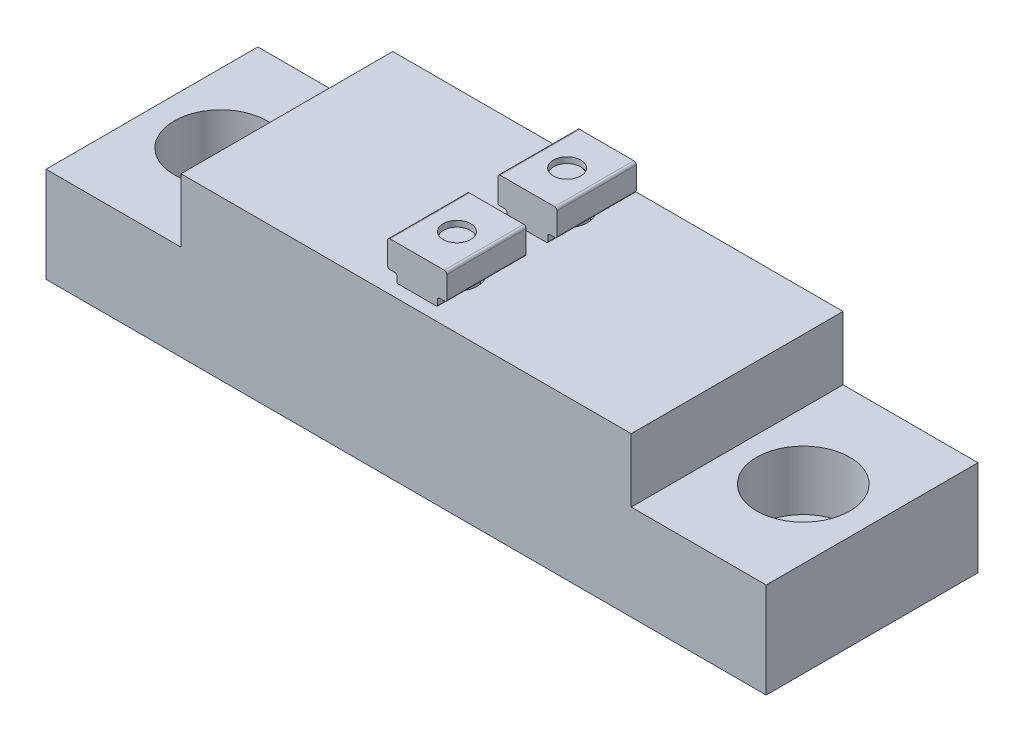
ISO-10303-21;
HEADER;
FILE_DESCRIPTION(('STEP AP214'),'2;1');
FILE_NAME('part.step','',(''),(''),'','','');
FILE_SCHEMA(('AUTOMOTIVE_DESIGN { 1 0 10303 214 1 1 1 1 }'));
ENDSEC;
DATA;
#1=APPLICATION_CONTEXT('core data for automotive mechanical design processes');
#2=APPLICATION_PROTOCOL_DEFINITION('international standard','automotive_design',2000,#1);
#3=PRODUCT_CONTEXT('',#1,'mechanical');
#4=PRODUCT('Part','Part','',(#3));
#5=PRODUCT_RELATED_PRODUCT_CATEGORY('part','',(#4));
#6=PRODUCT_DEFINITION_FORMATION('','',#4);
#7=PRODUCT_DEFINITION_CONTEXT('part definition',#1,'design');
#8=PRODUCT_DEFINITION('design','',#6,#7);
#9=PRODUCT_DEFINITION_SHAPE('','',#8);
#10=(LENGTH_UNIT() NAMED_UNIT(*) SI_UNIT(.MILLI.,.METRE.));
#11=(NAMED_UNIT(*) PLANE_ANGLE_UNIT() SI_UNIT($,.RADIAN.));
#12=(NAMED_UNIT(*) SI_UNIT($,.STERADIAN.) SOLID_ANGLE_UNIT());
#13=UNCERTAINTY_MEASURE_WITH_UNIT(LENGTH_MEASURE(1.E-05),#10,'distance_accuracy_value','');
#14=(GEOMETRIC_REPRESENTATION_CONTEXT(3) GLOBAL_UNCERTAINTY_ASSIGNED_CONTEXT((#13)) GLOBAL_UNIT_ASSIGNED_CONTEXT((#10,
#11,#12)) REPRESENTATION_CONTEXT('',''));
#15=CARTESIAN_POINT('',(0.,0.,0.));
#16=DIRECTION('',(0.,0.,1.));
#17=DIRECTION('',(1.,0.,0.));
#18=AXIS2_PLACEMENT_3D('',#15,#16,#17);
#19=CARTESIAN_POINT('',(-34.925,-7.62,0.));
#20=DIRECTION('',(0.,1.,0.));
#21=DIRECTION('',(0.,0.,1.));
#22=AXIS2_PLACEMENT_3D('',#19,#20,#21);
#23=CYLINDRICAL_SURFACE('',#22,5.588);
#24=CARTESIAN_POINT('',(-34.925,-14.732,0.));
#25=DIRECTION('',(0.,1.,0.));
#26=DIRECTION('',(0.,0.,1.));
#27=AXIS2_PLACEMENT_3D('',#24,#25,#26);
#28=CIRCLE('',#27,5.588);
#29=CARTESIAN_POINT('',(-34.925,-14.732,5.588));
#30=VERTEX_POINT('',#29);
#31=EDGE_CURVE('E727',#30,#30,#28,.T.);
#32=ORIENTED_EDGE('',*,*,#31,.F.);
#33=EDGE_LOOP('',(#32));
#34=FACE_BOUND('',#33,.T.);
#35=CARTESIAN_POINT('',(-34.925,-7.62,0.));
#36=DIRECTION('',(0.,1.,0.));
#37=DIRECTION('',(0.,0.,1.));
#38=AXIS2_PLACEMENT_3D('',#35,#36,#37);
#39=CIRCLE('',#38,5.588);
#40=CARTESIAN_POINT('',(-34.925,-7.62,5.588));
#41=VERTEX_POINT('',#40);
#42=EDGE_CURVE('E723',#41,#41,#39,.T.);
#43=ORIENTED_EDGE('',*,*,#42,.T.);
#44=EDGE_LOOP('',(#43));
#45=FACE_BOUND('',#44,.T.);
#46=ADVANCED_FACE('F14',(#34,#45),#23,.F.);
#47=CARTESIAN_POINT('',(34.925,-7.62,0.));
#48=DIRECTION('',(0.,1.,0.));
#49=DIRECTION('',(0.,0.,1.));
#50=AXIS2_PLACEMENT_3D('',#47,#48,#49);
#51=CYLINDRICAL_SURFACE('',#50,5.588);
#52=CARTESIAN_POINT('',(34.925,-14.732,0.));
#53=DIRECTION('',(0.,1.,0.));
#54=DIRECTION('',(0.,0.,1.));
#55=AXIS2_PLACEMENT_3D('',#52,#53,#54);
#56=CIRCLE('',#55,5.588);
#57=CARTESIAN_POINT('',(34.925,-14.732,5.588));
#58=VERTEX_POINT('',#57);
#59=EDGE_CURVE('E741',#58,#58,#56,.T.);
#60=ORIENTED_EDGE('',*,*,#59,.F.);
#61=EDGE_LOOP('',(#60));
#62=FACE_BOUND('',#61,.T.);
#63=CARTESIAN_POINT('',(34.925,-7.62,0.));
#64=DIRECTION('',(0.,1.,0.));
#65=DIRECTION('',(0.,0.,1.));
#66=AXIS2_PLACEMENT_3D('',#63,#64,#65);
#67=CIRCLE('',#66,5.588);
#68=CARTESIAN_POINT('',(34.925,-7.62,5.588));
#69=VERTEX_POINT('',#68);
#70=EDGE_CURVE('E738',#69,#69,#67,.T.);
#71=ORIENTED_EDGE('',*,*,#70,.T.);
#72=EDGE_LOOP('',(#71));
#73=FACE_BOUND('',#72,.T.);
#74=ADVANCED_FACE('F860',(#62,#73),#51,.F.);
#75=CARTESIAN_POINT('',(38.4937,-14.732,0.));
#76=DIRECTION('',(0.,-1.,0.));
#77=DIRECTION('',(0.,0.,-1.));
#78=AXIS2_PLACEMENT_3D('',#75,#76,#77);
#79=PLANE('',#78);
#80=CARTESIAN_POINT('',(34.925,-14.732,0.));
#81=DIRECTION('',(0.,1.,0.));
#82=DIRECTION('',(0.,0.,1.));
#83=AXIS2_PLACEMENT_3D('',#80,#81,#82);
#84=CIRCLE('',#83,3.5687);
#85=CARTESIAN_POINT('',(34.925,-14.732,3.5687));
#86=VERTEX_POINT('',#85);
#87=EDGE_CURVE('E744',#86,#86,#84,.T.);
#88=ORIENTED_EDGE('',*,*,#87,.F.);
#89=EDGE_LOOP('',(#88));
#90=FACE_BOUND('',#89,.T.);
#91=ORIENTED_EDGE('',*,*,#59,.T.);
#92=EDGE_LOOP('',(#91));
#93=FACE_BOUND('',#92,.T.);
#94=ADVANCED_FACE('F866',(#90,#93),#79,.F.);
#95=CARTESIAN_POINT('',(-31.3563,-14.732,0.));
#96=DIRECTION('',(0.,-1.,0.));
#97=DIRECTION('',(0.,0.,-1.));
#98=AXIS2_PLACEMENT_3D('',#95,#96,#97);
#99=PLANE('',#98);
#100=CARTESIAN_POINT('',(-34.925,-14.732,0.));
#101=DIRECTION('',(0.,1.,0.));
#102=DIRECTION('',(0.,0.,1.));
#103=AXIS2_PLACEMENT_3D('',#100,#101,#102);
#104=CIRCLE('',#103,3.5687);
#105=CARTESIAN_POINT('',(-34.925,-14.732,3.5687));
#106=VERTEX_POINT('',#105);
#107=EDGE_CURVE('E732',#106,#106,#104,.T.);
#108=ORIENTED_EDGE('',*,*,#107,.F.);
#109=EDGE_LOOP('',(#108));
#110=FACE_BOUND('',#109,.T.);
#111=ORIENTED_EDGE('',*,*,#31,.T.);
#112=EDGE_LOOP('',(#111));
#113=FACE_BOUND('',#112,.T.);
#114=ADVANCED_FACE('F869',(#110,#113),#99,.F.);
#115=CARTESIAN_POINT('',(0.,-7.62,12.7));
#116=DIRECTION('',(0.,1.,0.));
#117=DIRECTION('',(0.,0.,1.));
#118=AXIS2_PLACEMENT_3D('',#115,#116,#117);
#119=PLANE('',#118);
#120=ORIENTED_EDGE('',*,*,#42,.F.);
#121=EDGE_LOOP('',(#120));
#122=FACE_BOUND('',#121,.T.);
#123=DIRECTION('',(1.,0.,0.));
#124=VECTOR('',#123,1.);
#125=CARTESIAN_POINT('',(0.,-7.62,-12.7));
#126=LINE('',#125,#124);
#127=CARTESIAN_POINT('',(-43.18,-7.62,-12.7));
#128=VERTEX_POINT('',#127);
#129=CARTESIAN_POINT('',(-26.995,-7.62,-12.7));
#130=VERTEX_POINT('',#129);
#131=EDGE_CURVE('E775',#128,#130,#126,.T.);
#132=ORIENTED_EDGE('',*,*,#131,.F.);
#133=DIRECTION('',(0.,0.,-1.));
#134=VECTOR('',#133,1.);
#135=CARTESIAN_POINT('',(-43.18,-7.62,12.7));
#136=LINE('',#135,#134);
#137=CARTESIAN_POINT('',(-43.18,-7.62,12.7));
#138=VERTEX_POINT('',#137);
#139=EDGE_CURVE('E829',#138,#128,#136,.T.);
#140=ORIENTED_EDGE('',*,*,#139,.F.);
#141=DIRECTION('',(1.,0.,0.));
#142=VECTOR('',#141,1.);
#143=CARTESIAN_POINT('',(0.,-7.62,12.7));
#144=LINE('',#143,#142);
#145=CARTESIAN_POINT('',(-26.995,-7.62,12.7));
#146=VERTEX_POINT('',#145);
#147=EDGE_CURVE('E796',#138,#146,#144,.T.);
#148=ORIENTED_EDGE('',*,*,#147,.T.);
#149=DIRECTION('',(0.,0.,-1.));
#150=VECTOR('',#149,1.);
#151=CARTESIAN_POINT('',(-26.995,-7.62,12.7));
#152=LINE('',#151,#150);
#153=EDGE_CURVE('E832',#146,#130,#152,.T.);
#154=ORIENTED_EDGE('',*,*,#153,.T.);
#155=EDGE_LOOP('',(#132,#140,#148,#154));
#156=FACE_BOUND('',#155,.T.);
#157=ADVANCED_FACE('F871',(#122,#156),#119,.T.);
#158=ORIENTED_EDGE('',*,*,#70,.F.);
#159=EDGE_LOOP('',(#158));
#160=FACE_BOUND('',#159,.T.);
#161=CARTESIAN_POINT('',(26.995,-7.62,-12.7));
#162=VERTEX_POINT('',#161);
#163=CARTESIAN_POINT('',(43.18,-7.62,-12.7));
#164=VERTEX_POINT('',#163);
#165=EDGE_CURVE('E779',#162,#164,#126,.T.);
#166=ORIENTED_EDGE('',*,*,#165,.F.);
#167=DIRECTION('',(0.,0.,-1.));
#168=VECTOR('',#167,1.);
#169=CARTESIAN_POINT('',(26.995,-7.62,12.7));
#170=LINE('',#169,#168);
#171=CARTESIAN_POINT('',(26.995,-7.62,12.7));
#172=VERTEX_POINT('',#171);
#173=EDGE_CURVE('E817',#172,#162,#170,.T.);
#174=ORIENTED_EDGE('',*,*,#173,.F.);
#175=CARTESIAN_POINT('',(43.18,-7.62,12.7));
#176=VERTEX_POINT('',#175);
#177=EDGE_CURVE('E800',#172,#176,#144,.T.);
#178=ORIENTED_EDGE('',*,*,#177,.T.);
#179=DIRECTION('',(0.,0.,-1.));
#180=VECTOR('',#179,1.);
#181=CARTESIAN_POINT('',(43.18,-7.62,12.7));
#182=LINE('',#181,#180);
#183=EDGE_CURVE('E820',#176,#164,#182,.T.);
#184=ORIENTED_EDGE('',*,*,#183,.T.);
#185=EDGE_LOOP('',(#166,#174,#178,#184));
#186=FACE_BOUND('',#185,.T.);
#187=ADVANCED_FACE('F877',(#160,#186),#119,.T.);
#188=CARTESIAN_POINT('',(-43.18,-81.2345217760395,12.7));
#189=DIRECTION('',(1.,0.,0.));
#190=DIRECTION('',(0.,0.,-1.));
#191=AXIS2_PLACEMENT_3D('',#188,#189,#190);
#192=PLANE('',#191);
#193=DIRECTION('',(0.,-1.,0.));
#194=VECTOR('',#193,1.);
#195=CARTESIAN_POINT('',(-43.18,-81.2345217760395,-12.7));
#196=LINE('',#195,#194);
#197=CARTESIAN_POINT('',(-43.18,-19.05,-12.7));
#198=VERTEX_POINT('',#197);
#199=EDGE_CURVE('E778',#128,#198,#196,.T.);
#200=ORIENTED_EDGE('',*,*,#199,.T.);
#201=DIRECTION('',(0.,0.,-1.));
#202=VECTOR('',#201,1.);
#203=CARTESIAN_POINT('',(-43.18,-19.05,12.7));
#204=LINE('',#203,#202);
#205=CARTESIAN_POINT('',(-43.18,-19.05,12.7));
#206=VERTEX_POINT('',#205);
#207=EDGE_CURVE('E826',#206,#198,#204,.T.);
#208=ORIENTED_EDGE('',*,*,#207,.F.);
#209=DIRECTION('',(0.,-1.,0.));
#210=VECTOR('',#209,1.);
#211=CARTESIAN_POINT('',(-43.18,-81.2345217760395,12.7));
#212=LINE('',#211,#210);
#213=EDGE_CURVE('E799',#138,#206,#212,.T.);
#214=ORIENTED_EDGE('',*,*,#213,.F.);
#215=ORIENTED_EDGE('',*,*,#139,.T.);
#216=EDGE_LOOP('',(#200,#208,#214,#215));
#217=FACE_BOUND('',#216,.T.);
#218=ADVANCED_FACE('F932',(#217),#192,.F.);
#219=CARTESIAN_POINT('',(43.18,-81.2345217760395,12.7));
#220=DIRECTION('',(1.,0.,0.));
#221=DIRECTION('',(0.,0.,-1.));
#222=AXIS2_PLACEMENT_3D('',#219,#220,#221);
#223=PLANE('',#222);
#224=DIRECTION('',(0.,-1.,0.));
#225=VECTOR('',#224,1.);
#226=CARTESIAN_POINT('',(43.18,-81.2345217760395,-12.7));
#227=LINE('',#226,#225);
#228=CARTESIAN_POINT('',(43.18,-19.05,-12.7));
#229=VERTEX_POINT('',#228);
#230=EDGE_CURVE('E785',#164,#229,#227,.T.);
#231=ORIENTED_EDGE('',*,*,#230,.F.);
#232=ORIENTED_EDGE('',*,*,#183,.F.);
#233=DIRECTION('',(0.,-1.,0.));
#234=VECTOR('',#233,1.);
#235=CARTESIAN_POINT('',(43.18,-81.2345217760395,12.7));
#236=LINE('',#235,#234);
#237=CARTESIAN_POINT('',(43.18,-19.05,12.7));
#238=VERTEX_POINT('',#237);
#239=EDGE_CURVE('E806',#176,#238,#236,.T.);
#240=ORIENTED_EDGE('',*,*,#239,.T.);
#241=DIRECTION('',(0.,0.,-1.));
#242=VECTOR('',#241,1.);
#243=CARTESIAN_POINT('',(43.18,-19.05,12.7));
#244=LINE('',#243,#242);
#245=EDGE_CURVE('E823',#238,#229,#244,.T.);
#246=ORIENTED_EDGE('',*,*,#245,.T.);
#247=EDGE_LOOP('',(#231,#232,#240,#246));
#248=FACE_BOUND('',#247,.T.);
#249=ADVANCED_FACE('F928',(#248),#223,.T.);
#250=CARTESIAN_POINT('',(26.995,-81.2345217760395,12.7));
#251=DIRECTION('',(-1.,0.,0.));
#252=DIRECTION('',(0.,0.,1.));
#253=AXIS2_PLACEMENT_3D('',#250,#251,#252);
#254=PLANE('',#253);
#255=DIRECTION('',(0.,1.,0.));
#256=VECTOR('',#255,1.);
#257=CARTESIAN_POINT('',(26.995,-81.2345217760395,-12.7));
#258=LINE('',#257,#256);
#259=CARTESIAN_POINT('',(26.995,0.,-12.7));
#260=VERTEX_POINT('',#259);
#261=EDGE_CURVE('E788',#162,#260,#258,.T.);
#262=ORIENTED_EDGE('',*,*,#261,.T.);
#263=DIRECTION('',(0.,0.,-1.));
#264=VECTOR('',#263,1.);
#265=CARTESIAN_POINT('',(26.995,0.,12.7));
#266=LINE('',#265,#264);
#267=CARTESIAN_POINT('',(26.995,0.,12.7));
#268=VERTEX_POINT('',#267);
#269=EDGE_CURVE('E814',#268,#260,#266,.T.);
#270=ORIENTED_EDGE('',*,*,#269,.F.);
#271=DIRECTION('',(0.,1.,0.));
#272=VECTOR('',#271,1.);
#273=CARTESIAN_POINT('',(26.995,-81.2345217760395,12.7));
#274=LINE('',#273,#272);
#275=EDGE_CURVE('E809',#172,#268,#274,.T.);
#276=ORIENTED_EDGE('',*,*,#275,.F.);
#277=ORIENTED_EDGE('',*,*,#173,.T.);
#278=EDGE_LOOP('',(#262,#270,#276,#277));
#279=FACE_BOUND('',#278,.T.);
#280=ADVANCED_FACE('F922',(#279),#254,.F.);
#281=CARTESIAN_POINT('',(0.,-81.2345217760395,12.7));
#282=DIRECTION('',(0.,0.,1.));
#283=DIRECTION('',(1.,0.,0.));
#284=AXIS2_PLACEMENT_3D('',#281,#282,#283);
#285=PLANE('',#284);
#286=DIRECTION('',(0.,1.,0.));
#287=VECTOR('',#286,1.);
#288=CARTESIAN_POINT('',(-26.995,-81.2345217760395,12.7));
#289=LINE('',#288,#287);
#290=CARTESIAN_POINT('',(-26.995,0.,12.7));
#291=VERTEX_POINT('',#290);
#292=EDGE_CURVE('E794',#146,#291,#289,.T.);
#293=ORIENTED_EDGE('',*,*,#292,.F.);
#294=ORIENTED_EDGE('',*,*,#147,.F.);
#295=ORIENTED_EDGE('',*,*,#213,.T.);
#296=DIRECTION('',(1.,0.,0.));
#297=VECTOR('',#296,1.);
#298=CARTESIAN_POINT('',(0.,-19.05,12.7));
#299=LINE('',#298,#297);
#300=EDGE_CURVE('E803',#206,#238,#299,.T.);
#301=ORIENTED_EDGE('',*,*,#300,.T.);
#302=ORIENTED_EDGE('',*,*,#239,.F.);
#303=ORIENTED_EDGE('',*,*,#177,.F.);
#304=ORIENTED_EDGE('',*,*,#275,.T.);
#305=DIRECTION('',(1.,0.,0.));
#306=VECTOR('',#305,1.);
#307=CARTESIAN_POINT('',(0.,0.,12.7));
#308=LINE('',#307,#306);
#309=EDGE_CURVE('E811',#291,#268,#308,.T.);
#310=ORIENTED_EDGE('',*,*,#309,.F.);
#311=EDGE_LOOP('',(#293,#294,#295,#301,#302,#303,#304,#310));
#312=FACE_BOUND('',#311,.T.);
#313=ADVANCED_FACE('F919',(#312),#285,.T.);
#314=CARTESIAN_POINT('',(-26.995,-81.2345217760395,12.7));
#315=DIRECTION('',(-1.,0.,0.));
#316=DIRECTION('',(0.,0.,1.));
#317=AXIS2_PLACEMENT_3D('',#314,#315,#316);
#318=PLANE('',#317);
#319=DIRECTION('',(0.,1.,0.));
#320=VECTOR('',#319,1.);
#321=CARTESIAN_POINT('',(-26.995,-81.2345217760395,-12.7));
#322=LINE('',#321,#320);
#323=CARTESIAN_POINT('',(-26.995,0.,-12.7));
#324=VERTEX_POINT('',#323);
#325=EDGE_CURVE('E772',#130,#324,#322,.T.);
#326=ORIENTED_EDGE('',*,*,#325,.F.);
#327=ORIENTED_EDGE('',*,*,#153,.F.);
#328=ORIENTED_EDGE('',*,*,#292,.T.);
#329=DIRECTION('',(0.,0.,-1.));
#330=VECTOR('',#329,1.);
#331=CARTESIAN_POINT('',(-26.995,0.,12.7));
#332=LINE('',#331,#330);
#333=EDGE_CURVE('E33',#291,#324,#332,.T.);
#334=ORIENTED_EDGE('',*,*,#333,.T.);
#335=EDGE_LOOP('',(#326,#327,#328,#334));
#336=FACE_BOUND('',#335,.T.);
#337=ADVANCED_FACE('F917',(#336),#318,.T.);
#338=CARTESIAN_POINT('',(0.,-81.2345217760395,-12.7));
#339=DIRECTION('',(0.,0.,1.));
#340=DIRECTION('',(1.,0.,0.));
#341=AXIS2_PLACEMENT_3D('',#338,#339,#340);
#342=PLANE('',#341);
#343=ORIENTED_EDGE('',*,*,#325,.T.);
#344=DIRECTION('',(1.,0.,0.));
#345=VECTOR('',#344,1.);
#346=CARTESIAN_POINT('',(0.,0.,-12.7));
#347=LINE('',#346,#345);
#348=EDGE_CURVE('E791',#324,#260,#347,.T.);
#349=ORIENTED_EDGE('',*,*,#348,.T.);
#350=ORIENTED_EDGE('',*,*,#261,.F.);
#351=ORIENTED_EDGE('',*,*,#165,.T.);
#352=ORIENTED_EDGE('',*,*,#230,.T.);
#353=DIRECTION('',(1.,0.,0.));
#354=VECTOR('',#353,1.);
#355=CARTESIAN_POINT('',(0.,-19.05,-12.7));
#356=LINE('',#355,#354);
#357=EDGE_CURVE('E782',#198,#229,#356,.T.);
#358=ORIENTED_EDGE('',*,*,#357,.F.);
#359=ORIENTED_EDGE('',*,*,#199,.F.);
#360=ORIENTED_EDGE('',*,*,#131,.T.);
#361=EDGE_LOOP('',(#343,#349,#350,#351,#352,#358,#359,#360));
#362=FACE_BOUND('',#361,.T.);
#363=ADVANCED_FACE('F914',(#362),#342,.F.);
#364=CARTESIAN_POINT('',(0.,0.,12.7));
#365=DIRECTION('',(0.,1.,0.));
#366=DIRECTION('',(0.,0.,1.));
#367=AXIS2_PLACEMENT_3D('',#364,#365,#366);
#368=PLANE('',#367);
#369=CARTESIAN_POINT('',(0.,0.,-6.604));
#370=DIRECTION('',(0.,-1.,0.));
#371=DIRECTION('',(0.,0.,-1.));
#372=AXIS2_PLACEMENT_3D('',#369,#370,#371);
#373=CIRCLE('',#372,2.4638);
#374=CARTESIAN_POINT('',(0.,0.,-9.0678));
#375=VERTEX_POINT('',#374);
#376=EDGE_CURVE('E757',#375,#375,#373,.T.);
#377=ORIENTED_EDGE('',*,*,#376,.T.);
#378=EDGE_LOOP('',(#377));
#379=FACE_BOUND('',#378,.T.);
#380=CARTESIAN_POINT('',(0.,0.,6.604));
#381=DIRECTION('',(0.,-1.,0.));
#382=DIRECTION('',(0.,0.,-1.));
#383=AXIS2_PLACEMENT_3D('',#380,#381,#382);
#384=CIRCLE('',#383,2.4638);
#385=CARTESIAN_POINT('',(0.,0.,4.1402));
#386=VERTEX_POINT('',#385);
#387=EDGE_CURVE('E769',#386,#386,#384,.T.);
#388=ORIENTED_EDGE('',*,*,#387,.T.);
#389=EDGE_LOOP('',(#388));
#390=FACE_BOUND('',#389,.T.);
#391=ORIENTED_EDGE('',*,*,#348,.F.);
#392=ORIENTED_EDGE('',*,*,#333,.F.);
#393=ORIENTED_EDGE('',*,*,#309,.T.);
#394=ORIENTED_EDGE('',*,*,#269,.T.);
#395=EDGE_LOOP('',(#391,#392,#393,#394));
#396=FACE_BOUND('',#395,.T.);
#397=ADVANCED_FACE('F900',(#379,#390,#396),#368,.T.);
#398=CARTESIAN_POINT('',(0.,-19.05,-6.604));
#399=DIRECTION('',(0.,-1.,0.));
#400=DIRECTION('',(0.,0.,-1.));
#401=AXIS2_PLACEMENT_3D('',#398,#399,#400);
#402=CYLINDRICAL_SURFACE('',#401,2.4638);
#403=ORIENTED_EDGE('',*,*,#376,.F.);
#404=EDGE_LOOP('',(#403));
#405=FACE_BOUND('',#404,.T.);
#406=CARTESIAN_POINT('',(0.,-14.224,-6.604));
#407=DIRECTION('',(0.,-1.,0.));
#408=DIRECTION('',(0.,0.,-1.));
#409=AXIS2_PLACEMENT_3D('',#406,#407,#408);
#410=CIRCLE('',#409,2.4638);
#411=CARTESIAN_POINT('',(0.,-14.224,-9.0678));
#412=VERTEX_POINT('',#411);
#413=EDGE_CURVE('E754',#412,#412,#410,.T.);
#414=ORIENTED_EDGE('',*,*,#413,.T.);
#415=EDGE_LOOP('',(#414));
#416=FACE_BOUND('',#415,.T.);
#417=ADVANCED_FACE('F897',(#405,#416),#402,.F.);
#418=CARTESIAN_POINT('',(0.,-19.05,6.604));
#419=DIRECTION('',(0.,-1.,0.));
#420=DIRECTION('',(0.,0.,-1.));
#421=AXIS2_PLACEMENT_3D('',#418,#419,#420);
#422=CYLINDRICAL_SURFACE('',#421,2.4638);
#423=ORIENTED_EDGE('',*,*,#387,.F.);
#424=EDGE_LOOP('',(#423));
#425=FACE_BOUND('',#424,.T.);
#426=CARTESIAN_POINT('',(0.,-14.224,6.604));
#427=DIRECTION('',(0.,-1.,0.));
#428=DIRECTION('',(0.,0.,-1.));
#429=AXIS2_PLACEMENT_3D('',#426,#427,#428);
#430=CIRCLE('',#429,2.4638);
#431=CARTESIAN_POINT('',(0.,-14.224,4.1402));
#432=VERTEX_POINT('',#431);
#433=EDGE_CURVE('E766',#432,#432,#430,.T.);
#434=ORIENTED_EDGE('',*,*,#433,.T.);
#435=EDGE_LOOP('',(#434));
#436=FACE_BOUND('',#435,.T.);
#437=ADVANCED_FACE('F854',(#425,#436),#422,.F.);
#438=CARTESIAN_POINT('',(34.925,-7.62,0.));
#439=DIRECTION('',(0.,1.,0.));
#440=DIRECTION('',(0.,0.,1.));
#441=AXIS2_PLACEMENT_3D('',#438,#439,#440);
#442=CYLINDRICAL_SURFACE('',#441,3.5687);
#443=ORIENTED_EDGE('',*,*,#87,.T.);
#444=EDGE_LOOP('',(#443));
#445=FACE_BOUND('',#444,.T.);
#446=CARTESIAN_POINT('',(34.925,-19.05,0.));
#447=DIRECTION('',(0.,1.,0.));
#448=DIRECTION('',(0.,0.,1.));
#449=AXIS2_PLACEMENT_3D('',#446,#447,#448);
#450=CIRCLE('',#449,3.5687);
#451=CARTESIAN_POINT('',(34.925,-19.05,3.5687));
#452=VERTEX_POINT('',#451);
#453=EDGE_CURVE('E747',#452,#452,#450,.T.);
#454=ORIENTED_EDGE('',*,*,#453,.F.);
#455=EDGE_LOOP('',(#454));
#456=FACE_BOUND('',#455,.T.);
#457=ADVANCED_FACE('F844',(#445,#456),#442,.F.);
#458=CARTESIAN_POINT('',(-34.925,-7.62,0.));
#459=DIRECTION('',(0.,1.,0.));
#460=DIRECTION('',(0.,0.,1.));
#461=AXIS2_PLACEMENT_3D('',#458,#459,#460);
#462=CYLINDRICAL_SURFACE('',#461,3.5687);
#463=ORIENTED_EDGE('',*,*,#107,.T.);
#464=EDGE_LOOP('',(#463));
#465=FACE_BOUND('',#464,.T.);
#466=CARTESIAN_POINT('',(-34.925,-19.05,0.));
#467=DIRECTION('',(0.,1.,0.));
#468=DIRECTION('',(0.,0.,1.));
#469=AXIS2_PLACEMENT_3D('',#466,#467,#468);
#470=CIRCLE('',#469,3.5687);
#471=CARTESIAN_POINT('',(-34.925,-19.05,3.5687));
#472=VERTEX_POINT('',#471);
#473=EDGE_CURVE('E737',#472,#472,#470,.T.);
#474=ORIENTED_EDGE('',*,*,#473,.F.);
#475=EDGE_LOOP('',(#474));
#476=FACE_BOUND('',#475,.T.);
#477=ADVANCED_FACE('F842',(#465,#476),#462,.F.);
#478=CARTESIAN_POINT('',(0.,-19.05,12.7));
#479=DIRECTION('',(0.,1.,0.));
#480=DIRECTION('',(0.,0.,1.));
#481=AXIS2_PLACEMENT_3D('',#478,#479,#480);
#482=PLANE('',#481);
#483=ORIENTED_EDGE('',*,*,#473,.T.);
#484=EDGE_LOOP('',(#483));
#485=FACE_BOUND('',#484,.T.);
#486=ORIENTED_EDGE('',*,*,#453,.T.);
#487=EDGE_LOOP('',(#486));
#488=FACE_BOUND('',#487,.T.);
#489=CARTESIAN_POINT('',(0.,-19.05,-6.604));
#490=DIRECTION('',(0.,-1.,0.));
#491=DIRECTION('',(0.,0.,-1.));
#492=AXIS2_PLACEMENT_3D('',#489,#490,#491);
#493=CIRCLE('',#492,3.937);
#494=CARTESIAN_POINT('',(0.,-19.05,-10.541));
#495=VERTEX_POINT('',#494);
#496=EDGE_CURVE('E748',#495,#495,#493,.T.);
#497=ORIENTED_EDGE('',*,*,#496,.F.);
#498=EDGE_LOOP('',(#497));
#499=FACE_BOUND('',#498,.T.);
#500=CARTESIAN_POINT('',(0.,-19.05,6.604));
#501=DIRECTION('',(0.,-1.,0.));
#502=DIRECTION('',(0.,0.,-1.));
#503=AXIS2_PLACEMENT_3D('',#500,#501,#502);
#504=CIRCLE('',#503,3.937);
#505=CARTESIAN_POINT('',(0.,-19.05,2.667));
#506=VERTEX_POINT('',#505);
#507=EDGE_CURVE('E760',#506,#506,#504,.T.);
#508=ORIENTED_EDGE('',*,*,#507,.F.);
#509=EDGE_LOOP('',(#508));
#510=FACE_BOUND('',#509,.T.);
#511=ORIENTED_EDGE('',*,*,#357,.T.);
#512=ORIENTED_EDGE('',*,*,#245,.F.);
#513=ORIENTED_EDGE('',*,*,#300,.F.);
#514=ORIENTED_EDGE('',*,*,#207,.T.);
#515=EDGE_LOOP('',(#511,#512,#513,#514));
#516=FACE_BOUND('',#515,.T.);
#517=ADVANCED_FACE('F839',(#485,#488,#499,#510,#516),#482,.F.);
#518=CARTESIAN_POINT('',(0.,-19.05,-6.604));
#519=DIRECTION('',(0.,-1.,0.));
#520=DIRECTION('',(0.,0.,-1.));
#521=AXIS2_PLACEMENT_3D('',#518,#519,#520);
#522=CYLINDRICAL_SURFACE('',#521,3.937);
#523=CARTESIAN_POINT('',(0.,-14.224,-6.604));
#524=DIRECTION('',(0.,-1.,0.));
#525=DIRECTION('',(0.,0.,-1.));
#526=AXIS2_PLACEMENT_3D('',#523,#524,#525);
#527=CIRCLE('',#526,3.937);
#528=CARTESIAN_POINT('',(0.,-14.224,-10.541));
#529=VERTEX_POINT('',#528);
#530=EDGE_CURVE('E751',#529,#529,#527,.T.);
#531=ORIENTED_EDGE('',*,*,#530,.F.);
#532=EDGE_LOOP('',(#531));
#533=FACE_BOUND('',#532,.T.);
#534=ORIENTED_EDGE('',*,*,#496,.T.);
#535=EDGE_LOOP('',(#534));
#536=FACE_BOUND('',#535,.T.);
#537=ADVANCED_FACE('F852',(#533,#536),#522,.F.);
#538=CARTESIAN_POINT('',(2.4638,-14.224,-6.604));
#539=DIRECTION('',(0.,1.,0.));
#540=DIRECTION('',(0.,0.,1.));
#541=AXIS2_PLACEMENT_3D('',#538,#539,#540);
#542=PLANE('',#541);
#543=CARTESIAN_POINT('',(0.,-14.224,-6.604));
#544=DIRECTION('',(0.,1.,0.));
#545=DIRECTION('',(0.,0.,1.));
#546=AXIS2_PLACEMENT_3D('',#543,#544,#545);
#547=CIRCLE('',#546,3.5);
#548=CARTESIAN_POINT('',(0.,-14.224,-3.104));
#549=VERTEX_POINT('',#548);
#550=EDGE_CURVE('E24',#549,#549,#547,.T.);
#551=ORIENTED_EDGE('',*,*,#550,.T.);
#552=EDGE_LOOP('',(#551));
#553=FACE_BOUND('',#552,.T.);
#554=ORIENTED_EDGE('',*,*,#530,.T.);
#555=EDGE_LOOP('',(#554));
#556=FACE_BOUND('',#555,.T.);
#557=ADVANCED_FACE('F891',(#553,#556),#542,.F.);
#558=CARTESIAN_POINT('',(0.,-19.05,6.604));
#559=DIRECTION('',(0.,-1.,0.));
#560=DIRECTION('',(0.,0.,-1.));
#561=AXIS2_PLACEMENT_3D('',#558,#559,#560);
#562=CYLINDRICAL_SURFACE('',#561,3.937);
#563=CARTESIAN_POINT('',(0.,-14.224,6.604));
#564=DIRECTION('',(0.,-1.,0.));
#565=DIRECTION('',(0.,0.,-1.));
#566=AXIS2_PLACEMENT_3D('',#563,#564,#565);
#567=CIRCLE('',#566,3.937);
#568=CARTESIAN_POINT('',(0.,-14.224,2.667));
#569=VERTEX_POINT('',#568);
#570=EDGE_CURVE('E763',#569,#569,#567,.T.);
#571=ORIENTED_EDGE('',*,*,#570,.F.);
#572=EDGE_LOOP('',(#571));
#573=FACE_BOUND('',#572,.T.);
#574=ORIENTED_EDGE('',*,*,#507,.T.);
#575=EDGE_LOOP('',(#574));
#576=FACE_BOUND('',#575,.T.);
#577=ADVANCED_FACE('F895',(#573,#576),#562,.F.);
#578=CARTESIAN_POINT('',(2.4638,-14.224,6.604));
#579=DIRECTION('',(0.,1.,0.));
#580=DIRECTION('',(0.,0.,1.));
#581=AXIS2_PLACEMENT_3D('',#578,#579,#580);
#582=PLANE('',#581);
#583=CARTESIAN_POINT('',(0.,-14.224,6.604));
#584=DIRECTION('',(0.,1.,0.));
#585=DIRECTION('',(0.5,0.,-0.866025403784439));
#586=AXIS2_PLACEMENT_3D('',#583,#584,#585);
#587=CIRCLE('',#586,3.5);
#588=CARTESIAN_POINT('',(1.75,-14.224,3.57291108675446));
#589=VERTEX_POINT('',#588);
#590=EDGE_CURVE('E9',#589,#589,#587,.T.);
#591=ORIENTED_EDGE('',*,*,#590,.T.);
#592=EDGE_LOOP('',(#591));
#593=FACE_BOUND('',#592,.T.);
#594=ORIENTED_EDGE('',*,*,#570,.T.);
#595=EDGE_LOOP('',(#594));
#596=FACE_BOUND('',#595,.T.);
#597=ADVANCED_FACE('F904',(#593,#596),#582,.F.);
#598=CARTESIAN_POINT('',(-0.866025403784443,-16.224,-8.104));
#599=DIRECTION('',(0.,1.,0.));
#600=DIRECTION('',(-1.,0.,0.));
#601=AXIS2_PLACEMENT_3D('',#598,#599,#600);
#602=PLANE('',#601);
#603=DIRECTION('',(1.,0.,0.));
#604=VECTOR('',#603,1.);
#605=CARTESIAN_POINT('',(-0.866025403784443,-16.224,-8.104));
#606=LINE('',#605,#604);
#607=CARTESIAN_POINT('',(-0.866025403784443,-16.224,-8.104));
#608=VERTEX_POINT('',#607);
#609=CARTESIAN_POINT('',(0.866025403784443,-16.224,-8.104));
#610=VERTEX_POINT('',#609);
#611=EDGE_CURVE('E345',#608,#610,#606,.T.);
#612=ORIENTED_EDGE('',*,*,#611,.T.);
#613=DIRECTION('',(0.5,0.,0.866025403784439));
#614=VECTOR('',#613,1.);
#615=CARTESIAN_POINT('',(0.866025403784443,-16.224,-8.104));
#616=LINE('',#615,#614);
#617=CARTESIAN_POINT('',(1.73205080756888,-16.224,-6.604));
#618=VERTEX_POINT('',#617);
#619=EDGE_CURVE('E323',#610,#618,#616,.T.);
#620=ORIENTED_EDGE('',*,*,#619,.T.);
#621=DIRECTION('',(-0.5,0.,0.866025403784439));
#622=VECTOR('',#621,1.);
#623=CARTESIAN_POINT('',(1.73205080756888,-16.224,-6.604));
#624=LINE('',#623,#622);
#625=CARTESIAN_POINT('',(0.866025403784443,-16.224,-5.104));
#626=VERTEX_POINT('',#625);
#627=EDGE_CURVE('E348',#618,#626,#624,.T.);
#628=ORIENTED_EDGE('',*,*,#627,.T.);
#629=DIRECTION('',(-1.,0.,0.));
#630=VECTOR('',#629,1.);
#631=CARTESIAN_POINT('',(0.866025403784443,-16.224,-5.104));
#632=LINE('',#631,#630);
#633=CARTESIAN_POINT('',(-0.866025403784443,-16.224,-5.104));
#634=VERTEX_POINT('',#633);
#635=EDGE_CURVE('E351',#626,#634,#632,.T.);
#636=ORIENTED_EDGE('',*,*,#635,.T.);
#637=DIRECTION('',(-0.5,0.,-0.866025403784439));
#638=VECTOR('',#637,1.);
#639=CARTESIAN_POINT('',(-0.866025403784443,-16.224,-5.104));
#640=LINE('',#639,#638);
#641=CARTESIAN_POINT('',(-1.73205080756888,-16.224,-6.604));
#642=VERTEX_POINT('',#641);
#643=EDGE_CURVE('E354',#634,#642,#640,.T.);
#644=ORIENTED_EDGE('',*,*,#643,.T.);
#645=DIRECTION('',(0.5,0.,-0.866025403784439));
#646=VECTOR('',#645,1.);
#647=CARTESIAN_POINT('',(-1.73205080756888,-16.224,-6.604));
#648=LINE('',#647,#646);
#649=EDGE_CURVE('E326',#642,#608,#648,.T.);
#650=ORIENTED_EDGE('',*,*,#649,.T.);
#651=EDGE_LOOP('',(#612,#620,#628,#636,#644,#650));
#652=FACE_BOUND('',#651,.T.);
#653=ADVANCED_FACE('F908',(#652),#602,.F.);
#654=CARTESIAN_POINT('',(0.866025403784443,-16.224,-8.104));
#655=DIRECTION('',(0.866025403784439,0.,-0.5));
#656=DIRECTION('',(0.5,0.,0.866025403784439));
#657=AXIS2_PLACEMENT_3D('',#654,#655,#656);
#658=PLANE('',#657);
#659=DIRECTION('',(0.5,0.,0.866025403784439));
#660=VECTOR('',#659,1.);
#661=CARTESIAN_POINT('',(0.866025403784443,-18.224,-8.104));
#662=LINE('',#661,#660);
#663=CARTESIAN_POINT('',(0.866025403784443,-18.224,-8.104));
#664=VERTEX_POINT('',#663);
#665=CARTESIAN_POINT('',(1.73205080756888,-18.224,-6.604));
#666=VERTEX_POINT('',#665);
#667=EDGE_CURVE('E316',#664,#666,#662,.T.);
#668=ORIENTED_EDGE('',*,*,#667,.T.);
#669=DIRECTION('',(0.,-1.,0.));
#670=VECTOR('',#669,1.);
#671=CARTESIAN_POINT('',(1.73205080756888,-16.224,-6.604));
#672=LINE('',#671,#670);
#673=EDGE_CURVE('E325',#618,#666,#672,.T.);
#674=ORIENTED_EDGE('',*,*,#673,.F.);
#675=ORIENTED_EDGE('',*,*,#619,.F.);
#676=DIRECTION('',(0.,-1.,0.));
#677=VECTOR('',#676,1.);
#678=CARTESIAN_POINT('',(0.866025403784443,-16.224,-8.104));
#679=LINE('',#678,#677);
#680=EDGE_CURVE('E311',#610,#664,#679,.T.);
#681=ORIENTED_EDGE('',*,*,#680,.T.);
#682=EDGE_LOOP('',(#668,#674,#675,#681));
#683=FACE_BOUND('',#682,.T.);
#684=ADVANCED_FACE('F320',(#683),#658,.F.);
#685=CARTESIAN_POINT('',(1.73205080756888,-16.224,-6.604));
#686=DIRECTION('',(0.866025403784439,0.,0.5));
#687=DIRECTION('',(-0.5,0.,0.866025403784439));
#688=AXIS2_PLACEMENT_3D('',#685,#686,#687);
#689=PLANE('',#688);
#690=DIRECTION('',(-0.5,0.,0.866025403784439));
#691=VECTOR('',#690,1.);
#692=CARTESIAN_POINT('',(1.73205080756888,-18.224,-6.604));
#693=LINE('',#692,#691);
#694=CARTESIAN_POINT('',(0.866025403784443,-18.224,-5.104));
#695=VERTEX_POINT('',#694);
#696=EDGE_CURVE('E332',#666,#695,#693,.T.);
#697=ORIENTED_EDGE('',*,*,#696,.T.);
#698=DIRECTION('',(0.,-1.,0.));
#699=VECTOR('',#698,1.);
#700=CARTESIAN_POINT('',(0.866025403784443,-16.224,-5.104));
#701=LINE('',#700,#699);
#702=EDGE_CURVE('E365',#626,#695,#701,.T.);
#703=ORIENTED_EDGE('',*,*,#702,.F.);
#704=ORIENTED_EDGE('',*,*,#627,.F.);
#705=ORIENTED_EDGE('',*,*,#673,.T.);
#706=EDGE_LOOP('',(#697,#703,#704,#705));
#707=FACE_BOUND('',#706,.T.);
#708=ADVANCED_FACE('F1161',(#707),#689,.F.);
#709=CARTESIAN_POINT('',(0.866025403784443,-16.224,-5.104));
#710=DIRECTION('',(0.,0.,1.));
#711=DIRECTION('',(-1.,0.,0.));
#712=AXIS2_PLACEMENT_3D('',#709,#710,#711);
#713=PLANE('',#712);
#714=DIRECTION('',(-1.,0.,0.));
#715=VECTOR('',#714,1.);
#716=CARTESIAN_POINT('',(0.866025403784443,-18.224,-5.104));
#717=LINE('',#716,#715);
#718=CARTESIAN_POINT('',(-0.866025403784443,-18.224,-5.104));
#719=VERTEX_POINT('',#718);
#720=EDGE_CURVE('E334',#695,#719,#717,.T.);
#721=ORIENTED_EDGE('',*,*,#720,.T.);
#722=DIRECTION('',(0.,-1.,0.));
#723=VECTOR('',#722,1.);
#724=CARTESIAN_POINT('',(-0.866025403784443,-16.224,-5.104));
#725=LINE('',#724,#723);
#726=EDGE_CURVE('E363',#634,#719,#725,.T.);
#727=ORIENTED_EDGE('',*,*,#726,.F.);
#728=ORIENTED_EDGE('',*,*,#635,.F.);
#729=ORIENTED_EDGE('',*,*,#702,.T.);
#730=EDGE_LOOP('',(#721,#727,#728,#729));
#731=FACE_BOUND('',#730,.T.);
#732=ADVANCED_FACE('F1157',(#731),#713,.F.);
#733=CARTESIAN_POINT('',(-0.866025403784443,-16.224,-5.104));
#734=DIRECTION('',(-0.866025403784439,0.,0.5));
#735=DIRECTION('',(-0.5,0.,-0.866025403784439));
#736=AXIS2_PLACEMENT_3D('',#733,#734,#735);
#737=PLANE('',#736);
#738=DIRECTION('',(-0.5,0.,-0.866025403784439));
#739=VECTOR('',#738,1.);
#740=CARTESIAN_POINT('',(-0.866025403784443,-18.224,-5.104));
#741=LINE('',#740,#739);
#742=CARTESIAN_POINT('',(-1.73205080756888,-18.224,-6.604));
#743=VERTEX_POINT('',#742);
#744=EDGE_CURVE('E340',#719,#743,#741,.T.);
#745=ORIENTED_EDGE('',*,*,#744,.T.);
#746=DIRECTION('',(0.,-1.,0.));
#747=VECTOR('',#746,1.);
#748=CARTESIAN_POINT('',(-1.73205080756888,-16.224,-6.604));
#749=LINE('',#748,#747);
#750=EDGE_CURVE('E361',#642,#743,#749,.T.);
#751=ORIENTED_EDGE('',*,*,#750,.F.);
#752=ORIENTED_EDGE('',*,*,#643,.F.);
#753=ORIENTED_EDGE('',*,*,#726,.T.);
#754=EDGE_LOOP('',(#745,#751,#752,#753));
#755=FACE_BOUND('',#754,.T.);
#756=ADVANCED_FACE('F1154',(#755),#737,.F.);
#757=CARTESIAN_POINT('',(-1.73205080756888,-16.224,-6.604));
#758=DIRECTION('',(-0.866025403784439,0.,-0.5));
#759=DIRECTION('',(0.5,0.,-0.866025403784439));
#760=AXIS2_PLACEMENT_3D('',#757,#758,#759);
#761=PLANE('',#760);
#762=DIRECTION('',(0.5,0.,-0.866025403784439));
#763=VECTOR('',#762,1.);
#764=CARTESIAN_POINT('',(-1.73205080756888,-18.224,-6.604));
#765=LINE('',#764,#763);
#766=CARTESIAN_POINT('',(-0.866025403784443,-18.224,-8.104));
#767=VERTEX_POINT('',#766);
#768=EDGE_CURVE('E343',#743,#767,#765,.T.);
#769=ORIENTED_EDGE('',*,*,#768,.T.);
#770=DIRECTION('',(0.,-1.,0.));
#771=VECTOR('',#770,1.);
#772=CARTESIAN_POINT('',(-0.866025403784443,-16.224,-8.104));
#773=LINE('',#772,#771);
#774=EDGE_CURVE('E303',#608,#767,#773,.T.);
#775=ORIENTED_EDGE('',*,*,#774,.F.);
#776=ORIENTED_EDGE('',*,*,#649,.F.);
#777=ORIENTED_EDGE('',*,*,#750,.T.);
#778=EDGE_LOOP('',(#769,#775,#776,#777));
#779=FACE_BOUND('',#778,.T.);
#780=ADVANCED_FACE('F1151',(#779),#761,.F.);
#781=CARTESIAN_POINT('',(-0.866025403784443,-16.224,-8.104));
#782=DIRECTION('',(0.,0.,-1.));
#783=DIRECTION('',(1.,0.,0.));
#784=AXIS2_PLACEMENT_3D('',#781,#782,#783);
#785=PLANE('',#784);
#786=DIRECTION('',(1.,0.,0.));
#787=VECTOR('',#786,1.);
#788=CARTESIAN_POINT('',(-0.866025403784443,-18.224,-8.104));
#789=LINE('',#788,#787);
#790=EDGE_CURVE('E308',#767,#664,#789,.T.);
#791=ORIENTED_EDGE('',*,*,#790,.T.);
#792=ORIENTED_EDGE('',*,*,#680,.F.);
#793=ORIENTED_EDGE('',*,*,#611,.F.);
#794=ORIENTED_EDGE('',*,*,#774,.T.);
#795=EDGE_LOOP('',(#791,#792,#793,#794));
#796=FACE_BOUND('',#795,.T.);
#797=ADVANCED_FACE('F310',(#796),#785,.F.);
#798=CARTESIAN_POINT('',(0.,-18.224,-3.504));
#799=DIRECTION('',(0.,-1.,0.));
#800=DIRECTION('',(1.,0.,0.));
#801=AXIS2_PLACEMENT_3D('',#798,#799,#800);
#802=PLANE('',#801);
#803=ORIENTED_EDGE('',*,*,#790,.F.);
#804=ORIENTED_EDGE('',*,*,#768,.F.);
#805=ORIENTED_EDGE('',*,*,#744,.F.);
#806=ORIENTED_EDGE('',*,*,#720,.F.);
#807=ORIENTED_EDGE('',*,*,#696,.F.);
#808=ORIENTED_EDGE('',*,*,#667,.F.);
#809=EDGE_LOOP('',(#803,#804,#805,#806,#807,#808));
#810=FACE_BOUND('',#809,.T.);
#811=CARTESIAN_POINT('',(0.,-18.224,-6.604));
#812=DIRECTION('',(0.,1.,0.));
#813=DIRECTION('',(-1.,0.,0.));
#814=AXIS2_PLACEMENT_3D('',#811,#812,#813);
#815=CIRCLE('',#814,3.1);
#816=CARTESIAN_POINT('',(-3.1,-18.224,-6.604));
#817=VERTEX_POINT('',#816);
#818=EDGE_CURVE('E370',#817,#817,#815,.T.);
#819=ORIENTED_EDGE('',*,*,#818,.F.);
#820=EDGE_LOOP('',(#819));
#821=FACE_BOUND('',#820,.T.);
#822=ADVANCED_FACE('F328',(#810,#821),#802,.T.);
#823=CARTESIAN_POINT('',(0.,-17.824,-6.604));
#824=DIRECTION('',(0.,1.,0.));
#825=DIRECTION('',(-1.,0.,0.));
#826=AXIS2_PLACEMENT_3D('',#823,#824,#825);
#827=CONICAL_SURFACE('',#826,3.5,0.78539816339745);
#828=ORIENTED_EDGE('',*,*,#818,.T.);
#829=EDGE_LOOP('',(#828));
#830=FACE_BOUND('',#829,.T.);
#831=CARTESIAN_POINT('',(0.,-17.824,-6.604));
#832=DIRECTION('',(0.,1.,0.));
#833=DIRECTION('',(-1.,0.,0.));
#834=AXIS2_PLACEMENT_3D('',#831,#832,#833);
#835=CIRCLE('',#834,3.5);
#836=CARTESIAN_POINT('',(-3.5,-17.824,-6.604));
#837=VERTEX_POINT('',#836);
#838=EDGE_CURVE('E372',#837,#837,#835,.T.);
#839=ORIENTED_EDGE('',*,*,#838,.F.);
#840=EDGE_LOOP('',(#839));
#841=FACE_BOUND('',#840,.T.);
#842=ADVANCED_FACE('F1180',(#830,#841),#827,.T.);
#843=CARTESIAN_POINT('',(0.,-14.224,-6.604));
#844=DIRECTION('',(0.,1.,0.));
#845=DIRECTION('',(-1.,0.,0.));
#846=AXIS2_PLACEMENT_3D('',#843,#844,#845);
#847=CYLINDRICAL_SURFACE('',#846,3.5);
#848=ORIENTED_EDGE('',*,*,#838,.T.);
#849=EDGE_LOOP('',(#848));
#850=FACE_BOUND('',#849,.T.);
#851=ORIENTED_EDGE('',*,*,#550,.F.);
#852=EDGE_LOOP('',(#851));
#853=FACE_BOUND('',#852,.T.);
#854=ADVANCED_FACE('F910',(#850,#853),#847,.T.);
#855=CARTESIAN_POINT('',(0.,3.775964,-6.604));
#856=DIRECTION('',(0.,1.,0.));
#857=DIRECTION('',(-1.,0.,0.));
#858=AXIS2_PLACEMENT_3D('',#855,#856,#857);
#859=PLANE('',#858);
#860=CARTESIAN_POINT('',(0.,3.775964,-6.604));
#861=DIRECTION('',(0.,1.,0.));
#862=DIRECTION('',(-1.,0.,0.));
#863=AXIS2_PLACEMENT_3D('',#860,#861,#862);
#864=CIRCLE('',#863,1.6);
#865=CARTESIAN_POINT('',(-1.6,3.775964,-6.604));
#866=VERTEX_POINT('',#865);
#867=EDGE_CURVE('E360',#866,#866,#864,.T.);
#868=ORIENTED_EDGE('',*,*,#867,.T.);
#869=EDGE_LOOP('',(#868));
#870=FACE_BOUND('',#869,.T.);
#871=ADVANCED_FACE('F949',(#870),#859,.T.);
#872=CARTESIAN_POINT('',(0.,3.775964,-6.604));
#873=DIRECTION('',(0.,-1.,0.));
#874=DIRECTION('',(1.,0.,0.));
#875=AXIS2_PLACEMENT_3D('',#872,#873,#874);
#876=CONICAL_SURFACE('',#875,1.6,0.785398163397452);
#877=ORIENTED_EDGE('',*,*,#867,.F.);
#878=EDGE_LOOP('',(#877));
#879=FACE_BOUND('',#878,.T.);
#880=CARTESIAN_POINT('',(0.,3.725964,-6.604));
#881=DIRECTION('',(0.,-1.,0.));
#882=DIRECTION('',(0.,0.,-1.));
#883=AXIS2_PLACEMENT_3D('',#880,#881,#882);
#884=CIRCLE('',#883,1.65);
#885=CARTESIAN_POINT('',(0.,3.725964,-8.254));
#886=VERTEX_POINT('',#885);
#887=EDGE_CURVE('E718',#886,#886,#884,.T.);
#888=ORIENTED_EDGE('',*,*,#887,.F.);
#889=EDGE_LOOP('',(#888));
#890=FACE_BOUND('',#889,.T.);
#891=ADVANCED_FACE('F947',(#879,#890),#876,.T.);
#892=CARTESIAN_POINT('',(0.,0.2446,-6.604));
#893=DIRECTION('',(0.,-1.,0.));
#894=DIRECTION('',(0.,0.,1.));
#895=AXIS2_PLACEMENT_3D('',#892,#893,#894);
#896=CYLINDRICAL_SURFACE('',#895,1.65);
#897=ORIENTED_EDGE('',*,*,#887,.T.);
#898=EDGE_LOOP('',(#897));
#899=FACE_BOUND('',#898,.T.);
#900=CARTESIAN_POINT('',(0.,4.4446,-6.604));
#901=DIRECTION('',(0.,-1.,0.));
#902=DIRECTION('',(0.,0.,1.));
#903=AXIS2_PLACEMENT_3D('',#900,#901,#902);
#904=CIRCLE('',#903,1.65);
#905=CARTESIAN_POINT('',(0.,4.4446,-4.954));
#906=VERTEX_POINT('',#905);
#907=EDGE_CURVE('E584',#906,#906,#904,.T.);
#908=ORIENTED_EDGE('',*,*,#907,.F.);
#909=EDGE_LOOP('',(#908));
#910=FACE_BOUND('',#909,.T.);
#911=ADVANCED_FACE('F943',(#899,#910),#896,.F.);
#912=CARTESIAN_POINT('',(2.65,1.0446,-11.3665));
#913=DIRECTION('',(0.,0.,1.));
#914=DIRECTION('',(-1.,0.,0.));
#915=AXIS2_PLACEMENT_3D('',#912,#913,#914);
#916=CYLINDRICAL_SURFACE('',#915,0.2);
#917=CARTESIAN_POINT('',(2.65,1.0446,-1.8415));
#918=DIRECTION('',(0.,0.,-1.));
#919=DIRECTION('',(-1.,0.,0.));
#920=AXIS2_PLACEMENT_3D('',#917,#918,#919);
#921=CIRCLE('',#920,0.2);
#922=CARTESIAN_POINT('',(2.45,1.0446,-1.8415));
#923=VERTEX_POINT('',#922);
#924=CARTESIAN_POINT('',(2.65,1.2446,-1.8415));
#925=VERTEX_POINT('',#924);
#926=EDGE_CURVE('E654',#923,#925,#921,.T.);
#927=ORIENTED_EDGE('',*,*,#926,.F.);
#928=DIRECTION('',(0.,0.,1.));
#929=VECTOR('',#928,1.);
#930=CARTESIAN_POINT('',(2.45,1.0446,-11.3665));
#931=LINE('',#930,#929);
#932=CARTESIAN_POINT('',(2.45,1.0446,-11.3665));
#933=VERTEX_POINT('',#932);
#934=EDGE_CURVE('E694',#933,#923,#931,.T.);
#935=ORIENTED_EDGE('',*,*,#934,.F.);
#936=CARTESIAN_POINT('',(2.65,1.0446,-11.3665));
#937=DIRECTION('',(0.,0.,-1.));
#938=DIRECTION('',(-1.,0.,0.));
#939=AXIS2_PLACEMENT_3D('',#936,#937,#938);
#940=CIRCLE('',#939,0.2);
#941=CARTESIAN_POINT('',(2.65,1.2446,-11.3665));
#942=VERTEX_POINT('',#941);
#943=EDGE_CURVE('E616',#933,#942,#940,.T.);
#944=ORIENTED_EDGE('',*,*,#943,.T.);
#945=DIRECTION('',(0.,0.,1.));
#946=VECTOR('',#945,1.);
#947=CARTESIAN_POINT('',(2.65,1.2446,-11.3665));
#948=LINE('',#947,#946);
#949=EDGE_CURVE('E692',#942,#925,#948,.T.);
#950=ORIENTED_EDGE('',*,*,#949,.T.);
#951=EDGE_LOOP('',(#927,#935,#944,#950));
#952=FACE_BOUND('',#951,.T.);
#953=ADVANCED_FACE('F946',(#952),#916,.F.);
#954=CARTESIAN_POINT('',(3.295,1.2446,-11.3665));
#955=DIRECTION('',(0.,-1.,0.));
#956=DIRECTION('',(0.,0.,1.));
#957=AXIS2_PLACEMENT_3D('',#954,#955,#956);
#958=PLANE('',#957);
#959=DIRECTION('',(1.,0.,0.));
#960=VECTOR('',#959,1.);
#961=CARTESIAN_POINT('',(3.295,1.2446,-1.8415));
#962=LINE('',#961,#960);
#963=CARTESIAN_POINT('',(3.295,1.2446,-1.8415));
#964=VERTEX_POINT('',#963);
#965=EDGE_CURVE('E657',#925,#964,#962,.T.);
#966=ORIENTED_EDGE('',*,*,#965,.F.);
#967=ORIENTED_EDGE('',*,*,#949,.F.);
#968=DIRECTION('',(1.,0.,0.));
#969=VECTOR('',#968,1.);
#970=CARTESIAN_POINT('',(3.295,1.2446,-11.3665));
#971=LINE('',#970,#969);
#972=CARTESIAN_POINT('',(3.295,1.2446,-11.3665));
#973=VERTEX_POINT('',#972);
#974=EDGE_CURVE('E619',#942,#973,#971,.T.);
#975=ORIENTED_EDGE('',*,*,#974,.T.);
#976=DIRECTION('',(0.,0.,1.));
#977=VECTOR('',#976,1.);
#978=CARTESIAN_POINT('',(3.295,1.2446,-11.3665));
#979=LINE('',#978,#977);
#980=EDGE_CURVE('E690',#973,#964,#979,.T.);
#981=ORIENTED_EDGE('',*,*,#980,.T.);
#982=EDGE_LOOP('',(#966,#967,#975,#981));
#983=FACE_BOUND('',#982,.T.);
#984=ADVANCED_FACE('F984',(#983),#958,.T.);
#985=CARTESIAN_POINT('',(3.295,1.4946,-11.3665));
#986=DIRECTION('',(0.,0.,1.));
#987=DIRECTION('',(-1.,0.,0.));
#988=AXIS2_PLACEMENT_3D('',#985,#986,#987);
#989=CYLINDRICAL_SURFACE('',#988,0.25);
#990=CARTESIAN_POINT('',(3.295,1.4946,-1.8415));
#991=DIRECTION('',(0.,0.,1.));
#992=DIRECTION('',(1.,0.,0.));
#993=AXIS2_PLACEMENT_3D('',#990,#991,#992);
#994=CIRCLE('',#993,0.25);
#995=CARTESIAN_POINT('',(3.545,1.4946,-1.8415));
#996=VERTEX_POINT('',#995);
#997=EDGE_CURVE('E660',#964,#996,#994,.T.);
#998=ORIENTED_EDGE('',*,*,#997,.F.);
#999=ORIENTED_EDGE('',*,*,#980,.F.);
#1000=CARTESIAN_POINT('',(3.295,1.4946,-11.3665));
#1001=DIRECTION('',(0.,0.,1.));
#1002=DIRECTION('',(1.,0.,0.));
#1003=AXIS2_PLACEMENT_3D('',#1000,#1001,#1002);
#1004=CIRCLE('',#1003,0.25);
#1005=CARTESIAN_POINT('',(3.545,1.4946,-11.3665));
#1006=VERTEX_POINT('',#1005);
#1007=EDGE_CURVE('E622',#973,#1006,#1004,.T.);
#1008=ORIENTED_EDGE('',*,*,#1007,.T.);
#1009=DIRECTION('',(0.,0.,1.));
#1010=VECTOR('',#1009,1.);
#1011=CARTESIAN_POINT('',(3.545,1.4946,-11.3665));
#1012=LINE('',#1011,#1010);
#1013=EDGE_CURVE('E688',#1006,#996,#1012,.T.);
#1014=ORIENTED_EDGE('',*,*,#1013,.T.);
#1015=EDGE_LOOP('',(#998,#999,#1008,#1014));
#1016=FACE_BOUND('',#1015,.T.);
#1017=ADVANCED_FACE('F980',(#1016),#989,.T.);
#1018=CARTESIAN_POINT('',(3.545,1.4946,-11.3665));
#1019=DIRECTION('',(1.,0.,0.));
#1020=DIRECTION('',(0.,1.,0.));
#1021=AXIS2_PLACEMENT_3D('',#1018,#1019,#1020);
#1022=PLANE('',#1021);
#1023=DIRECTION('',(0.,1.,0.));
#1024=VECTOR('',#1023,1.);
#1025=CARTESIAN_POINT('',(3.545,1.4946,-1.8415));
#1026=LINE('',#1025,#1024);
#1027=CARTESIAN_POINT('',(3.545,4.1446,-1.8415));
#1028=VERTEX_POINT('',#1027);
#1029=EDGE_CURVE('E663',#996,#1028,#1026,.T.);
#1030=ORIENTED_EDGE('',*,*,#1029,.F.);
#1031=ORIENTED_EDGE('',*,*,#1013,.F.);
#1032=DIRECTION('',(0.,1.,0.));
#1033=VECTOR('',#1032,1.);
#1034=CARTESIAN_POINT('',(3.545,1.4946,-11.3665));
#1035=LINE('',#1034,#1033);
#1036=CARTESIAN_POINT('',(3.545,4.1446,-11.3665));
#1037=VERTEX_POINT('',#1036);
#1038=EDGE_CURVE('E625',#1006,#1037,#1035,.T.);
#1039=ORIENTED_EDGE('',*,*,#1038,.T.);
#1040=DIRECTION('',(0.,0.,1.));
#1041=VECTOR('',#1040,1.);
#1042=CARTESIAN_POINT('',(3.545,4.1446,-11.3665));
#1043=LINE('',#1042,#1041);
#1044=EDGE_CURVE('E686',#1037,#1028,#1043,.T.);
#1045=ORIENTED_EDGE('',*,*,#1044,.T.);
#1046=EDGE_LOOP('',(#1030,#1031,#1039,#1045));
#1047=FACE_BOUND('',#1046,.T.);
#1048=ADVANCED_FACE('F967',(#1047),#1022,.T.);
#1049=CARTESIAN_POINT('',(3.245,4.1446,-11.3665));
#1050=DIRECTION('',(0.,0.,1.));
#1051=DIRECTION('',(-1.,0.,0.));
#1052=AXIS2_PLACEMENT_3D('',#1049,#1050,#1051);
#1053=CYLINDRICAL_SURFACE('',#1052,0.3);
#1054=CARTESIAN_POINT('',(3.245,4.1446,-1.8415));
#1055=DIRECTION('',(0.,0.,1.));
#1056=DIRECTION('',(-1.,0.,0.));
#1057=AXIS2_PLACEMENT_3D('',#1054,#1055,#1056);
#1058=CIRCLE('',#1057,0.3);
#1059=CARTESIAN_POINT('',(3.245,4.4446,-1.8415));
#1060=VERTEX_POINT('',#1059);
#1061=EDGE_CURVE('E666',#1028,#1060,#1058,.T.);
#1062=ORIENTED_EDGE('',*,*,#1061,.F.);
#1063=ORIENTED_EDGE('',*,*,#1044,.F.);
#1064=CARTESIAN_POINT('',(3.245,4.1446,-11.3665));
#1065=DIRECTION('',(0.,0.,1.));
#1066=DIRECTION('',(-1.,0.,0.));
#1067=AXIS2_PLACEMENT_3D('',#1064,#1065,#1066);
#1068=CIRCLE('',#1067,0.3);
#1069=CARTESIAN_POINT('',(3.245,4.4446,-11.3665));
#1070=VERTEX_POINT('',#1069);
#1071=EDGE_CURVE('E628',#1037,#1070,#1068,.T.);
#1072=ORIENTED_EDGE('',*,*,#1071,.T.);
#1073=DIRECTION('',(0.,0.,1.));
#1074=VECTOR('',#1073,1.);
#1075=CARTESIAN_POINT('',(3.245,4.4446,-11.3665));
#1076=LINE('',#1075,#1074);
#1077=EDGE_CURVE('E684',#1070,#1060,#1076,.T.);
#1078=ORIENTED_EDGE('',*,*,#1077,.T.);
#1079=EDGE_LOOP('',(#1062,#1063,#1072,#1078));
#1080=FACE_BOUND('',#1079,.T.);
#1081=ADVANCED_FACE('F972',(#1080),#1053,.T.);
#1082=CARTESIAN_POINT('',(-3.245,4.4446,-11.3665));
#1083=DIRECTION('',(0.,1.,0.));
#1084=DIRECTION('',(0.,0.,-1.));
#1085=AXIS2_PLACEMENT_3D('',#1082,#1083,#1084);
#1086=PLANE('',#1085);
#1087=ORIENTED_EDGE('',*,*,#907,.T.);
#1088=EDGE_LOOP('',(#1087));
#1089=FACE_BOUND('',#1088,.T.);
#1090=DIRECTION('',(-1.,0.,0.));
#1091=VECTOR('',#1090,1.);
#1092=CARTESIAN_POINT('',(-3.245,4.4446,-1.8415));
#1093=LINE('',#1092,#1091);
#1094=CARTESIAN_POINT('',(-3.245,4.4446,-1.8415));
#1095=VERTEX_POINT('',#1094);
#1096=EDGE_CURVE('E669',#1060,#1095,#1093,.T.);
#1097=ORIENTED_EDGE('',*,*,#1096,.F.);
#1098=ORIENTED_EDGE('',*,*,#1077,.F.);
#1099=DIRECTION('',(-1.,0.,0.));
#1100=VECTOR('',#1099,1.);
#1101=CARTESIAN_POINT('',(-3.245,4.4446,-11.3665));
#1102=LINE('',#1101,#1100);
#1103=CARTESIAN_POINT('',(-3.245,4.4446,-11.3665));
#1104=VERTEX_POINT('',#1103);
#1105=EDGE_CURVE('E631',#1070,#1104,#1102,.T.);
#1106=ORIENTED_EDGE('',*,*,#1105,.T.);
#1107=DIRECTION('',(0.,0.,1.));
#1108=VECTOR('',#1107,1.);
#1109=CARTESIAN_POINT('',(-3.245,4.4446,-11.3665));
#1110=LINE('',#1109,#1108);
#1111=EDGE_CURVE('E682',#1104,#1095,#1110,.T.);
#1112=ORIENTED_EDGE('',*,*,#1111,.T.);
#1113=EDGE_LOOP('',(#1097,#1098,#1106,#1112));
#1114=FACE_BOUND('',#1113,.T.);
#1115=ADVANCED_FACE('F948',(#1089,#1114),#1086,.T.);
#1116=CARTESIAN_POINT('',(-3.245,4.1446,-11.3665));
#1117=DIRECTION('',(0.,0.,1.));
#1118=DIRECTION('',(-1.,0.,0.));
#1119=AXIS2_PLACEMENT_3D('',#1116,#1117,#1118);
#1120=CYLINDRICAL_SURFACE('',#1119,0.3);
#1121=CARTESIAN_POINT('',(-3.245,4.1446,-1.8415));
#1122=DIRECTION('',(0.,0.,1.));
#1123=DIRECTION('',(1.,0.,0.));
#1124=AXIS2_PLACEMENT_3D('',#1121,#1122,#1123);
#1125=CIRCLE('',#1124,0.3);
#1126=CARTESIAN_POINT('',(-3.545,4.1446,-1.8415));
#1127=VERTEX_POINT('',#1126);
#1128=EDGE_CURVE('E672',#1095,#1127,#1125,.T.);
#1129=ORIENTED_EDGE('',*,*,#1128,.F.);
#1130=ORIENTED_EDGE('',*,*,#1111,.F.);
#1131=CARTESIAN_POINT('',(-3.245,4.1446,-11.3665));
#1132=DIRECTION('',(0.,0.,1.));
#1133=DIRECTION('',(1.,0.,0.));
#1134=AXIS2_PLACEMENT_3D('',#1131,#1132,#1133);
#1135=CIRCLE('',#1134,0.3);
#1136=CARTESIAN_POINT('',(-3.545,4.1446,-11.3665));
#1137=VERTEX_POINT('',#1136);
#1138=EDGE_CURVE('E634',#1104,#1137,#1135,.T.);
#1139=ORIENTED_EDGE('',*,*,#1138,.T.);
#1140=DIRECTION('',(0.,0.,1.));
#1141=VECTOR('',#1140,1.);
#1142=CARTESIAN_POINT('',(-3.545,4.1446,-11.3665));
#1143=LINE('',#1142,#1141);
#1144=EDGE_CURVE('E680',#1137,#1127,#1143,.T.);
#1145=ORIENTED_EDGE('',*,*,#1144,.T.);
#1146=EDGE_LOOP('',(#1129,#1130,#1139,#1145));
#1147=FACE_BOUND('',#1146,.T.);
#1148=ADVANCED_FACE('F965',(#1147),#1120,.T.);
#1149=CARTESIAN_POINT('',(-3.545,1.4946,-11.3665));
#1150=DIRECTION('',(-1.,0.,0.));
#1151=DIRECTION('',(0.,-1.,0.));
#1152=AXIS2_PLACEMENT_3D('',#1149,#1150,#1151);
#1153=PLANE('',#1152);
#1154=DIRECTION('',(0.,-1.,0.));
#1155=VECTOR('',#1154,1.);
#1156=CARTESIAN_POINT('',(-3.545,1.4946,-1.8415));
#1157=LINE('',#1156,#1155);
#1158=CARTESIAN_POINT('',(-3.545,1.4946,-1.8415));
#1159=VERTEX_POINT('',#1158);
#1160=EDGE_CURVE('E602',#1127,#1159,#1157,.T.);
#1161=ORIENTED_EDGE('',*,*,#1160,.F.);
#1162=ORIENTED_EDGE('',*,*,#1144,.F.);
#1163=DIRECTION('',(0.,-1.,0.));
#1164=VECTOR('',#1163,1.);
#1165=CARTESIAN_POINT('',(-3.545,1.4946,-11.3665));
#1166=LINE('',#1165,#1164);
#1167=CARTESIAN_POINT('',(-3.545,1.4946,-11.3665));
#1168=VERTEX_POINT('',#1167);
#1169=EDGE_CURVE('E637',#1137,#1168,#1166,.T.);
#1170=ORIENTED_EDGE('',*,*,#1169,.T.);
#1171=DIRECTION('',(0.,0.,1.));
#1172=VECTOR('',#1171,1.);
#1173=CARTESIAN_POINT('',(-3.545,1.4946,-11.3665));
#1174=LINE('',#1173,#1172);
#1175=EDGE_CURVE('E677',#1168,#1159,#1174,.T.);
#1176=ORIENTED_EDGE('',*,*,#1175,.T.);
#1177=EDGE_LOOP('',(#1161,#1162,#1170,#1176));
#1178=FACE_BOUND('',#1177,.T.);
#1179=ADVANCED_FACE('F961',(#1178),#1153,.T.);
#1180=CARTESIAN_POINT('',(-3.295,1.4946,-11.3665));
#1181=DIRECTION('',(0.,0.,1.));
#1182=DIRECTION('',(-1.,0.,0.));
#1183=AXIS2_PLACEMENT_3D('',#1180,#1181,#1182);
#1184=CYLINDRICAL_SURFACE('',#1183,0.25);
#1185=CARTESIAN_POINT('',(-3.295,1.4946,-1.8415));
#1186=DIRECTION('',(0.,0.,1.));
#1187=DIRECTION('',(-1.,0.,0.));
#1188=AXIS2_PLACEMENT_3D('',#1185,#1186,#1187);
#1189=CIRCLE('',#1188,0.25);
#1190=CARTESIAN_POINT('',(-3.295,1.2446,-1.8415));
#1191=VERTEX_POINT('',#1190);
#1192=EDGE_CURVE('E588',#1159,#1191,#1189,.T.);
#1193=ORIENTED_EDGE('',*,*,#1192,.F.);
#1194=ORIENTED_EDGE('',*,*,#1175,.F.);
#1195=CARTESIAN_POINT('',(-3.295,1.4946,-11.3665));
#1196=DIRECTION('',(0.,0.,1.));
#1197=DIRECTION('',(-1.,0.,0.));
#1198=AXIS2_PLACEMENT_3D('',#1195,#1196,#1197);
#1199=CIRCLE('',#1198,0.25);
#1200=CARTESIAN_POINT('',(-3.295,1.2446,-11.3665));
#1201=VERTEX_POINT('',#1200);
#1202=EDGE_CURVE('E598',#1168,#1201,#1199,.T.);
#1203=ORIENTED_EDGE('',*,*,#1202,.T.);
#1204=DIRECTION('',(0.,0.,1.));
#1205=VECTOR('',#1204,1.);
#1206=CARTESIAN_POINT('',(-3.295,1.2446,-11.3665));
#1207=LINE('',#1206,#1205);
#1208=EDGE_CURVE('E639',#1201,#1191,#1207,.T.);
#1209=ORIENTED_EDGE('',*,*,#1208,.T.);
#1210=EDGE_LOOP('',(#1193,#1194,#1203,#1209));
#1211=FACE_BOUND('',#1210,.T.);
#1212=ADVANCED_FACE('F964',(#1211),#1184,.T.);
#1213=CARTESIAN_POINT('',(-3.295,1.2446,-11.3665));
#1214=DIRECTION('',(0.,-1.,0.));
#1215=DIRECTION('',(0.,0.,1.));
#1216=AXIS2_PLACEMENT_3D('',#1213,#1214,#1215);
#1217=PLANE('',#1216);
#1218=DIRECTION('',(1.,0.,0.));
#1219=VECTOR('',#1218,1.);
#1220=CARTESIAN_POINT('',(-3.295,1.2446,-1.8415));
#1221=LINE('',#1220,#1219);
#1222=CARTESIAN_POINT('',(-2.65,1.2446,-1.8415));
#1223=VERTEX_POINT('',#1222);
#1224=EDGE_CURVE('E593',#1191,#1223,#1221,.T.);
#1225=ORIENTED_EDGE('',*,*,#1224,.F.);
#1226=ORIENTED_EDGE('',*,*,#1208,.F.);
#1227=DIRECTION('',(1.,0.,0.));
#1228=VECTOR('',#1227,1.);
#1229=CARTESIAN_POINT('',(-3.295,1.2446,-11.3665));
#1230=LINE('',#1229,#1228);
#1231=CARTESIAN_POINT('',(-2.65,1.2446,-11.3665));
#1232=VERTEX_POINT('',#1231);
#1233=EDGE_CURVE('E601',#1201,#1232,#1230,.T.);
#1234=ORIENTED_EDGE('',*,*,#1233,.T.);
#1235=DIRECTION('',(0.,0.,1.));
#1236=VECTOR('',#1235,1.);
#1237=CARTESIAN_POINT('',(-2.65,1.2446,-11.3665));
#1238=LINE('',#1237,#1236);
#1239=EDGE_CURVE('E699',#1232,#1223,#1238,.T.);
#1240=ORIENTED_EDGE('',*,*,#1239,.T.);
#1241=EDGE_LOOP('',(#1225,#1226,#1234,#1240));
#1242=FACE_BOUND('',#1241,.T.);
#1243=ADVANCED_FACE('F1006',(#1242),#1217,.T.);
#1244=CARTESIAN_POINT('',(-2.65,1.0446,-11.3665));
#1245=DIRECTION('',(0.,0.,1.));
#1246=DIRECTION('',(-1.,0.,0.));
#1247=AXIS2_PLACEMENT_3D('',#1244,#1245,#1246);
#1248=CYLINDRICAL_SURFACE('',#1247,0.2);
#1249=CARTESIAN_POINT('',(-2.65,1.0446,-1.8415));
#1250=DIRECTION('',(0.,0.,-1.));
#1251=DIRECTION('',(-1.,0.,0.));
#1252=AXIS2_PLACEMENT_3D('',#1249,#1250,#1251);
#1253=CIRCLE('',#1252,0.2);
#1254=CARTESIAN_POINT('',(-2.45,1.0446,-1.8415));
#1255=VERTEX_POINT('',#1254);
#1256=EDGE_CURVE('E643',#1223,#1255,#1253,.T.);
#1257=ORIENTED_EDGE('',*,*,#1256,.F.);
#1258=ORIENTED_EDGE('',*,*,#1239,.F.);
#1259=CARTESIAN_POINT('',(-2.65,1.0446,-11.3665));
#1260=DIRECTION('',(0.,0.,-1.));
#1261=DIRECTION('',(-1.,0.,0.));
#1262=AXIS2_PLACEMENT_3D('',#1259,#1260,#1261);
#1263=CIRCLE('',#1262,0.2);
#1264=CARTESIAN_POINT('',(-2.45,1.0446,-11.3665));
#1265=VERTEX_POINT('',#1264);
#1266=EDGE_CURVE('E605',#1232,#1265,#1263,.T.);
#1267=ORIENTED_EDGE('',*,*,#1266,.T.);
#1268=DIRECTION('',(0.,0.,1.));
#1269=VECTOR('',#1268,1.);
#1270=CARTESIAN_POINT('',(-2.45,1.0446,-11.3665));
#1271=LINE('',#1270,#1269);
#1272=EDGE_CURVE('E697',#1265,#1255,#1271,.T.);
#1273=ORIENTED_EDGE('',*,*,#1272,.T.);
#1274=EDGE_LOOP('',(#1257,#1258,#1267,#1273));
#1275=FACE_BOUND('',#1274,.T.);
#1276=ADVANCED_FACE('F1002',(#1275),#1248,.F.);
#1277=CARTESIAN_POINT('',(-2.45,1.0446,-11.3665));
#1278=DIRECTION('',(-1.,0.,0.));
#1279=DIRECTION('',(0.,-1.,0.));
#1280=AXIS2_PLACEMENT_3D('',#1277,#1278,#1279);
#1281=PLANE('',#1280);
#1282=DIRECTION('',(0.,-1.,0.));
#1283=VECTOR('',#1282,1.);
#1284=CARTESIAN_POINT('',(-2.45,1.0446,-11.3665));
#1285=LINE('',#1284,#1283);
#1286=CARTESIAN_POINT('',(-2.45,0.3746,-11.3665));
#1287=VERTEX_POINT('',#1286);
#1288=EDGE_CURVE('E608',#1265,#1287,#1285,.T.);
#1289=ORIENTED_EDGE('',*,*,#1288,.T.);
#1290=DIRECTION('',(0.,0.,1.));
#1291=VECTOR('',#1290,1.);
#1292=CARTESIAN_POINT('',(-2.45,0.3746,-11.3665));
#1293=LINE('',#1292,#1291);
#1294=CARTESIAN_POINT('',(-2.45,0.3746,-1.8415));
#1295=VERTEX_POINT('',#1294);
#1296=EDGE_CURVE('E716',#1287,#1295,#1293,.T.);
#1297=ORIENTED_EDGE('',*,*,#1296,.T.);
#1298=DIRECTION('',(0.,-1.,0.));
#1299=VECTOR('',#1298,1.);
#1300=CARTESIAN_POINT('',(-2.45,1.0446,-1.8415));
#1301=LINE('',#1300,#1299);
#1302=EDGE_CURVE('E646',#1255,#1295,#1301,.T.);
#1303=ORIENTED_EDGE('',*,*,#1302,.F.);
#1304=ORIENTED_EDGE('',*,*,#1272,.F.);
#1305=EDGE_LOOP('',(#1289,#1297,#1303,#1304));
#1306=FACE_BOUND('',#1305,.T.);
#1307=ADVANCED_FACE('F994',(#1306),#1281,.T.);
#1308=CARTESIAN_POINT('',(2.45,1.0446,-11.3665));
#1309=DIRECTION('',(1.,0.,0.));
#1310=DIRECTION('',(0.,1.,0.));
#1311=AXIS2_PLACEMENT_3D('',#1308,#1309,#1310);
#1312=PLANE('',#1311);
#1313=DIRECTION('',(0.,1.,0.));
#1314=VECTOR('',#1313,1.);
#1315=CARTESIAN_POINT('',(2.45,1.0446,-1.8415));
#1316=LINE('',#1315,#1314);
#1317=CARTESIAN_POINT('',(2.45,0.3746,-1.8415));
#1318=VERTEX_POINT('',#1317);
#1319=EDGE_CURVE('E652',#1318,#923,#1316,.T.);
#1320=ORIENTED_EDGE('',*,*,#1319,.F.);
#1321=DIRECTION('',(0.,0.,1.));
#1322=VECTOR('',#1321,1.);
#1323=CARTESIAN_POINT('',(2.45,0.3746,-11.3665));
#1324=LINE('',#1323,#1322);
#1325=CARTESIAN_POINT('',(2.45,0.3746,-11.3665));
#1326=VERTEX_POINT('',#1325);
#1327=EDGE_CURVE('E710',#1318,#1326,#1324,.F.);
#1328=ORIENTED_EDGE('',*,*,#1327,.T.);
#1329=DIRECTION('',(0.,1.,0.));
#1330=VECTOR('',#1329,1.);
#1331=CARTESIAN_POINT('',(2.45,1.0446,-11.3665));
#1332=LINE('',#1331,#1330);
#1333=EDGE_CURVE('E614',#1326,#933,#1332,.T.);
#1334=ORIENTED_EDGE('',*,*,#1333,.T.);
#1335=ORIENTED_EDGE('',*,*,#934,.T.);
#1336=EDGE_LOOP('',(#1320,#1328,#1334,#1335));
#1337=FACE_BOUND('',#1336,.T.);
#1338=ADVANCED_FACE('F971',(#1337),#1312,.T.);
#1339=CARTESIAN_POINT('',(-2.32,0.3746,-11.3665));
#1340=DIRECTION('',(0.,0.,1.));
#1341=DIRECTION('',(-1.,0.,0.));
#1342=AXIS2_PLACEMENT_3D('',#1339,#1340,#1341);
#1343=CYLINDRICAL_SURFACE('',#1342,0.13);
#1344=CARTESIAN_POINT('',(-2.32,0.3746,-11.3665));
#1345=DIRECTION('',(0.,0.,1.));
#1346=DIRECTION('',(-1.,0.,0.));
#1347=AXIS2_PLACEMENT_3D('',#1344,#1345,#1346);
#1348=CIRCLE('',#1347,0.13);
#1349=CARTESIAN_POINT('',(-2.32,0.2446,-11.3665));
#1350=VERTEX_POINT('',#1349);
#1351=EDGE_CURVE('E712',#1350,#1287,#1348,.F.);
#1352=ORIENTED_EDGE('',*,*,#1351,.F.);
#1353=DIRECTION('',(0.,0.,1.));
#1354=VECTOR('',#1353,1.);
#1355=CARTESIAN_POINT('',(-2.32,0.2446,-11.3665));
#1356=LINE('',#1355,#1354);
#1357=CARTESIAN_POINT('',(-2.32,0.2446,-1.8415));
#1358=VERTEX_POINT('',#1357);
#1359=EDGE_CURVE('E679',#1358,#1350,#1356,.F.);
#1360=ORIENTED_EDGE('',*,*,#1359,.F.);
#1361=CARTESIAN_POINT('',(-2.32,0.3746,-1.8415));
#1362=DIRECTION('',(0.,0.,1.));
#1363=DIRECTION('',(-1.,0.,0.));
#1364=AXIS2_PLACEMENT_3D('',#1361,#1362,#1363);
#1365=CIRCLE('',#1364,0.13);
#1366=EDGE_CURVE('E706',#1295,#1358,#1365,.T.);
#1367=ORIENTED_EDGE('',*,*,#1366,.F.);
#1368=ORIENTED_EDGE('',*,*,#1296,.F.);
#1369=EDGE_LOOP('',(#1352,#1360,#1367,#1368));
#1370=FACE_BOUND('',#1369,.T.);
#1371=ADVANCED_FACE('F959',(#1370),#1343,.T.);
#1372=CARTESIAN_POINT('',(-3.295,1.4946,-1.8415));
#1373=DIRECTION('',(0.,0.,1.));
#1374=DIRECTION('',(-1.,0.,0.));
#1375=AXIS2_PLACEMENT_3D('',#1372,#1373,#1374);
#1376=PLANE('',#1375);
#1377=DIRECTION('',(1.,0.,0.));
#1378=VECTOR('',#1377,1.);
#1379=CARTESIAN_POINT('',(2.45,0.2446,-1.8415));
#1380=LINE('',#1379,#1378);
#1381=CARTESIAN_POINT('',(2.32,0.2446,-1.8415));
#1382=VERTEX_POINT('',#1381);
#1383=EDGE_CURVE('E649',#1358,#1382,#1380,.T.);
#1384=ORIENTED_EDGE('',*,*,#1383,.T.);
#1385=CARTESIAN_POINT('',(2.32,0.3746,-1.8415));
#1386=DIRECTION('',(0.,0.,1.));
#1387=DIRECTION('',(-1.,0.,0.));
#1388=AXIS2_PLACEMENT_3D('',#1385,#1386,#1387);
#1389=CIRCLE('',#1388,0.13);
#1390=EDGE_CURVE('E708',#1382,#1318,#1389,.T.);
#1391=ORIENTED_EDGE('',*,*,#1390,.T.);
#1392=ORIENTED_EDGE('',*,*,#1319,.T.);
#1393=ORIENTED_EDGE('',*,*,#926,.T.);
#1394=ORIENTED_EDGE('',*,*,#965,.T.);
#1395=ORIENTED_EDGE('',*,*,#997,.T.);
#1396=ORIENTED_EDGE('',*,*,#1029,.T.);
#1397=ORIENTED_EDGE('',*,*,#1061,.T.);
#1398=ORIENTED_EDGE('',*,*,#1096,.T.);
#1399=ORIENTED_EDGE('',*,*,#1128,.T.);
#1400=ORIENTED_EDGE('',*,*,#1160,.T.);
#1401=ORIENTED_EDGE('',*,*,#1192,.T.);
#1402=ORIENTED_EDGE('',*,*,#1224,.T.);
#1403=ORIENTED_EDGE('',*,*,#1256,.T.);
#1404=ORIENTED_EDGE('',*,*,#1302,.T.);
#1405=ORIENTED_EDGE('',*,*,#1366,.T.);
#1406=EDGE_LOOP('',(#1384,#1391,#1392,#1393,#1394,#1395,#1396,#1397,#1398,#1399,#1400,#1401,
#1402,#1403,#1404,#1405));
#1407=FACE_BOUND('',#1406,.T.);
#1408=ADVANCED_FACE('F956',(#1407),#1376,.T.);
#1409=CARTESIAN_POINT('',(2.32,0.3746,-11.3665));
#1410=DIRECTION('',(0.,0.,1.));
#1411=DIRECTION('',(-1.,0.,0.));
#1412=AXIS2_PLACEMENT_3D('',#1409,#1410,#1411);
#1413=CYLINDRICAL_SURFACE('',#1412,0.13);
#1414=CARTESIAN_POINT('',(2.32,0.3746,-11.3665));
#1415=DIRECTION('',(0.,0.,1.));
#1416=DIRECTION('',(-1.,0.,0.));
#1417=AXIS2_PLACEMENT_3D('',#1414,#1415,#1416);
#1418=CIRCLE('',#1417,0.13);
#1419=CARTESIAN_POINT('',(2.32,0.2446,-11.3665));
#1420=VERTEX_POINT('',#1419);
#1421=EDGE_CURVE('E714',#1326,#1420,#1418,.F.);
#1422=ORIENTED_EDGE('',*,*,#1421,.F.);
#1423=ORIENTED_EDGE('',*,*,#1327,.F.);
#1424=ORIENTED_EDGE('',*,*,#1390,.F.);
#1425=DIRECTION('',(0.,0.,1.));
#1426=VECTOR('',#1425,1.);
#1427=CARTESIAN_POINT('',(2.32,0.2446,-11.3665));
#1428=LINE('',#1427,#1426);
#1429=EDGE_CURVE('E703',#1420,#1382,#1428,.T.);
#1430=ORIENTED_EDGE('',*,*,#1429,.F.);
#1431=EDGE_LOOP('',(#1422,#1423,#1424,#1430));
#1432=FACE_BOUND('',#1431,.T.);
#1433=ADVANCED_FACE('F954',(#1432),#1413,.T.);
#1434=CARTESIAN_POINT('',(-3.295,1.4946,-11.3665));
#1435=DIRECTION('',(0.,0.,1.));
#1436=DIRECTION('',(-1.,0.,0.));
#1437=AXIS2_PLACEMENT_3D('',#1434,#1435,#1436);
#1438=PLANE('',#1437);
#1439=ORIENTED_EDGE('',*,*,#1333,.F.);
#1440=ORIENTED_EDGE('',*,*,#1421,.T.);
#1441=DIRECTION('',(1.,0.,0.));
#1442=VECTOR('',#1441,1.);
#1443=CARTESIAN_POINT('',(2.45,0.2446,-11.3665));
#1444=LINE('',#1443,#1442);
#1445=EDGE_CURVE('E611',#1350,#1420,#1444,.T.);
#1446=ORIENTED_EDGE('',*,*,#1445,.F.);
#1447=ORIENTED_EDGE('',*,*,#1351,.T.);
#1448=ORIENTED_EDGE('',*,*,#1288,.F.);
#1449=ORIENTED_EDGE('',*,*,#1266,.F.);
#1450=ORIENTED_EDGE('',*,*,#1233,.F.);
#1451=ORIENTED_EDGE('',*,*,#1202,.F.);
#1452=ORIENTED_EDGE('',*,*,#1169,.F.);
#1453=ORIENTED_EDGE('',*,*,#1138,.F.);
#1454=ORIENTED_EDGE('',*,*,#1105,.F.);
#1455=ORIENTED_EDGE('',*,*,#1071,.F.);
#1456=ORIENTED_EDGE('',*,*,#1038,.F.);
#1457=ORIENTED_EDGE('',*,*,#1007,.F.);
#1458=ORIENTED_EDGE('',*,*,#974,.F.);
#1459=ORIENTED_EDGE('',*,*,#943,.F.);
#1460=EDGE_LOOP('',(#1439,#1440,#1446,#1447,#1448,#1449,#1450,#1451,#1452,#1453,#1454,#1455,
#1456,#1457,#1458,#1459));
#1461=FACE_BOUND('',#1460,.T.);
#1462=ADVANCED_FACE('F950',(#1461),#1438,.F.);
#1463=CARTESIAN_POINT('',(2.45,0.2446,-11.3665));
#1464=DIRECTION('',(0.,-1.,0.));
#1465=DIRECTION('',(0.,0.,1.));
#1466=AXIS2_PLACEMENT_3D('',#1463,#1464,#1465);
#1467=PLANE('',#1466);
#1468=CARTESIAN_POINT('',(0.,0.2446,-6.604));
#1469=DIRECTION('',(0.,-1.,0.));
#1470=DIRECTION('',(0.,0.,-1.));
#1471=AXIS2_PLACEMENT_3D('',#1468,#1469,#1470);
#1472=CIRCLE('',#1471,2.);
#1473=CARTESIAN_POINT('',(0.,0.2446,-8.604));
#1474=VERTEX_POINT('',#1473);
#1475=EDGE_CURVE('E524',#1474,#1474,#1472,.T.);
#1476=ORIENTED_EDGE('',*,*,#1475,.F.);
#1477=EDGE_LOOP('',(#1476));
#1478=FACE_BOUND('',#1477,.T.);
#1479=ORIENTED_EDGE('',*,*,#1445,.T.);
#1480=ORIENTED_EDGE('',*,*,#1429,.T.);
#1481=ORIENTED_EDGE('',*,*,#1383,.F.);
#1482=ORIENTED_EDGE('',*,*,#1359,.T.);
#1483=EDGE_LOOP('',(#1479,#1480,#1481,#1482));
#1484=FACE_BOUND('',#1483,.T.);
#1485=ADVANCED_FACE('F953',(#1478,#1484),#1467,.T.);
#1486=CARTESIAN_POINT('',(0.,-14.224,-6.604));
#1487=DIRECTION('',(0.,1.,0.));
#1488=DIRECTION('',(-1.,0.,0.));
#1489=AXIS2_PLACEMENT_3D('',#1486,#1487,#1488);
#1490=CYLINDRICAL_SURFACE('',#1489,2.);
#1491=ORIENTED_EDGE('',*,*,#1475,.T.);
#1492=EDGE_LOOP('',(#1491));
#1493=FACE_BOUND('',#1492,.T.);
#1494=CARTESIAN_POINT('',(0.,-14.224,-6.604));
#1495=DIRECTION('',(0.,1.,0.));
#1496=DIRECTION('',(-1.,0.,0.));
#1497=AXIS2_PLACEMENT_3D('',#1494,#1495,#1496);
#1498=CIRCLE('',#1497,2.);
#1499=CARTESIAN_POINT('',(-2.,-14.224,-6.604));
#1500=VERTEX_POINT('',#1499);
#1501=EDGE_CURVE('E18',#1500,#1500,#1498,.T.);
#1502=ORIENTED_EDGE('',*,*,#1501,.T.);
#1503=EDGE_LOOP('',(#1502));
#1504=FACE_BOUND('',#1503,.T.);
#1505=ADVANCED_FACE('F998',(#1493,#1504),#1490,.T.);
#1506=CARTESIAN_POINT('',(0.,-14.224,-6.604));
#1507=DIRECTION('',(0.,1.,0.));
#1508=DIRECTION('',(-1.,0.,0.));
#1509=AXIS2_PLACEMENT_3D('',#1506,#1507,#1508);
#1510=PLANE('',#1509);
#1511=ORIENTED_EDGE('',*,*,#1501,.F.);
#1512=EDGE_LOOP('',(#1511));
#1513=FACE_BOUND('',#1512,.T.);
#1514=ORIENTED_EDGE('',*,*,#413,.F.);
#1515=EDGE_LOOP('',(#1514));
#1516=FACE_BOUND('',#1515,.T.);
#1517=ADVANCED_FACE('F16',(#1513,#1516),#1510,.T.);
#1518=CARTESIAN_POINT('',(1.73205080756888,-16.224,6.604));
#1519=DIRECTION('',(0.,1.,0.));
#1520=DIRECTION('',(0.5,0.,-0.866025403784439));
#1521=AXIS2_PLACEMENT_3D('',#1518,#1519,#1520);
#1522=PLANE('',#1521);
#1523=DIRECTION('',(-0.5,0.,0.866025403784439));
#1524=VECTOR('',#1523,1.);
#1525=CARTESIAN_POINT('',(1.73205080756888,-16.224,6.604));
#1526=LINE('',#1525,#1524);
#1527=CARTESIAN_POINT('',(1.73205080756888,-16.224,6.604));
#1528=VERTEX_POINT('',#1527);
#1529=CARTESIAN_POINT('',(0.866025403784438,-16.224,8.104));
#1530=VERTEX_POINT('',#1529);
#1531=EDGE_CURVE('E538',#1528,#1530,#1526,.T.);
#1532=ORIENTED_EDGE('',*,*,#1531,.T.);
#1533=DIRECTION('',(-1.,0.,0.));
#1534=VECTOR('',#1533,1.);
#1535=CARTESIAN_POINT('',(0.866025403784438,-16.224,8.104));
#1536=LINE('',#1535,#1534);
#1537=CARTESIAN_POINT('',(-0.866025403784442,-16.224,8.104));
#1538=VERTEX_POINT('',#1537);
#1539=EDGE_CURVE('E541',#1530,#1538,#1536,.T.);
#1540=ORIENTED_EDGE('',*,*,#1539,.T.);
#1541=DIRECTION('',(-0.5,0.,-0.866025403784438));
#1542=VECTOR('',#1541,1.);
#1543=CARTESIAN_POINT('',(-0.866025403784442,-16.224,8.104));
#1544=LINE('',#1543,#1542);
#1545=CARTESIAN_POINT('',(-1.73205080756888,-16.224,6.604));
#1546=VERTEX_POINT('',#1545);
#1547=EDGE_CURVE('E544',#1538,#1546,#1544,.T.);
#1548=ORIENTED_EDGE('',*,*,#1547,.T.);
#1549=DIRECTION('',(0.5,0.,-0.866025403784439));
#1550=VECTOR('',#1549,1.);
#1551=CARTESIAN_POINT('',(-1.73205080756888,-16.224,6.604));
#1552=LINE('',#1551,#1550);
#1553=CARTESIAN_POINT('',(-0.866025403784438,-16.224,5.104));
#1554=VERTEX_POINT('',#1553);
#1555=EDGE_CURVE('E547',#1546,#1554,#1552,.T.);
#1556=ORIENTED_EDGE('',*,*,#1555,.T.);
#1557=DIRECTION('',(1.,0.,0.));
#1558=VECTOR('',#1557,1.);
#1559=CARTESIAN_POINT('',(-0.866025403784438,-16.224,5.104));
#1560=LINE('',#1559,#1558);
#1561=CARTESIAN_POINT('',(0.866025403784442,-16.224,5.104));
#1562=VERTEX_POINT('',#1561);
#1563=EDGE_CURVE('E550',#1554,#1562,#1560,.T.);
#1564=ORIENTED_EDGE('',*,*,#1563,.T.);
#1565=DIRECTION('',(0.5,0.,0.866025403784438));
#1566=VECTOR('',#1565,1.);
#1567=CARTESIAN_POINT('',(0.866025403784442,-16.224,5.104));
#1568=LINE('',#1567,#1566);
#1569=EDGE_CURVE('E553',#1562,#1528,#1568,.T.);
#1570=ORIENTED_EDGE('',*,*,#1569,.T.);
#1571=EDGE_LOOP('',(#1532,#1540,#1548,#1556,#1564,#1570));
#1572=FACE_BOUND('',#1571,.T.);
#1573=ADVANCED_FACE('F1020',(#1572),#1522,.F.);
#1574=CARTESIAN_POINT('',(0.866025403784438,-16.224,8.104));
#1575=DIRECTION('',(0.,0.,1.));
#1576=DIRECTION('',(-1.,0.,0.));
#1577=AXIS2_PLACEMENT_3D('',#1574,#1575,#1576);
#1578=PLANE('',#1577);
#1579=DIRECTION('',(-1.,0.,0.));
#1580=VECTOR('',#1579,1.);
#1581=CARTESIAN_POINT('',(0.866025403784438,-18.224,8.104));
#1582=LINE('',#1581,#1580);
#1583=CARTESIAN_POINT('',(0.866025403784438,-18.224,8.104));
#1584=VERTEX_POINT('',#1583);
#1585=CARTESIAN_POINT('',(-0.866025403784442,-18.224,8.104));
#1586=VERTEX_POINT('',#1585);
#1587=EDGE_CURVE('E515',#1584,#1586,#1582,.T.);
#1588=ORIENTED_EDGE('',*,*,#1587,.T.);
#1589=DIRECTION('',(0.,-1.,0.));
#1590=VECTOR('',#1589,1.);
#1591=CARTESIAN_POINT('',(-0.866025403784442,-16.224,8.104));
#1592=LINE('',#1591,#1590);
#1593=EDGE_CURVE('E566',#1538,#1586,#1592,.T.);
#1594=ORIENTED_EDGE('',*,*,#1593,.F.);
#1595=ORIENTED_EDGE('',*,*,#1539,.F.);
#1596=DIRECTION('',(0.,-1.,0.));
#1597=VECTOR('',#1596,1.);
#1598=CARTESIAN_POINT('',(0.866025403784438,-16.224,8.104));
#1599=LINE('',#1598,#1597);
#1600=EDGE_CURVE('E556',#1530,#1584,#1599,.T.);
#1601=ORIENTED_EDGE('',*,*,#1600,.T.);
#1602=EDGE_LOOP('',(#1588,#1594,#1595,#1601));
#1603=FACE_BOUND('',#1602,.T.);
#1604=ADVANCED_FACE('F1023',(#1603),#1578,.F.);
#1605=CARTESIAN_POINT('',(-0.866025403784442,-16.224,8.104));
#1606=DIRECTION('',(-0.866025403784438,0.,0.5));
#1607=DIRECTION('',(-0.5,0.,-0.866025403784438));
#1608=AXIS2_PLACEMENT_3D('',#1605,#1606,#1607);
#1609=PLANE('',#1608);
#1610=DIRECTION('',(-0.5,0.,-0.866025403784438));
#1611=VECTOR('',#1610,1.);
#1612=CARTESIAN_POINT('',(-0.866025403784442,-18.224,8.104));
#1613=LINE('',#1612,#1611);
#1614=CARTESIAN_POINT('',(-1.73205080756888,-18.224,6.604));
#1615=VERTEX_POINT('',#1614);
#1616=EDGE_CURVE('E521',#1586,#1615,#1613,.T.);
#1617=ORIENTED_EDGE('',*,*,#1616,.T.);
#1618=DIRECTION('',(0.,-1.,0.));
#1619=VECTOR('',#1618,1.);
#1620=CARTESIAN_POINT('',(-1.73205080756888,-16.224,6.604));
#1621=LINE('',#1620,#1619);
#1622=EDGE_CURVE('E564',#1546,#1615,#1621,.T.);
#1623=ORIENTED_EDGE('',*,*,#1622,.F.);
#1624=ORIENTED_EDGE('',*,*,#1547,.F.);
#1625=ORIENTED_EDGE('',*,*,#1593,.T.);
#1626=EDGE_LOOP('',(#1617,#1623,#1624,#1625));
#1627=FACE_BOUND('',#1626,.T.);
#1628=ADVANCED_FACE('F1037',(#1627),#1609,.F.);
#1629=CARTESIAN_POINT('',(-1.73205080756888,-16.224,6.604));
#1630=DIRECTION('',(-0.866025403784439,0.,-0.5));
#1631=DIRECTION('',(0.5,0.,-0.866025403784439));
#1632=AXIS2_PLACEMENT_3D('',#1629,#1630,#1631);
#1633=PLANE('',#1632);
#1634=DIRECTION('',(0.5,0.,-0.866025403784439));
#1635=VECTOR('',#1634,1.);
#1636=CARTESIAN_POINT('',(-1.73205080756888,-18.224,6.604));
#1637=LINE('',#1636,#1635);
#1638=CARTESIAN_POINT('',(-0.866025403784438,-18.224,5.104));
#1639=VERTEX_POINT('',#1638);
#1640=EDGE_CURVE('E529',#1615,#1639,#1637,.T.);
#1641=ORIENTED_EDGE('',*,*,#1640,.T.);
#1642=DIRECTION('',(0.,-1.,0.));
#1643=VECTOR('',#1642,1.);
#1644=CARTESIAN_POINT('',(-0.866025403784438,-16.224,5.104));
#1645=LINE('',#1644,#1643);
#1646=EDGE_CURVE('E562',#1554,#1639,#1645,.T.);
#1647=ORIENTED_EDGE('',*,*,#1646,.F.);
#1648=ORIENTED_EDGE('',*,*,#1555,.F.);
#1649=ORIENTED_EDGE('',*,*,#1622,.T.);
#1650=EDGE_LOOP('',(#1641,#1647,#1648,#1649));
#1651=FACE_BOUND('',#1650,.T.);
#1652=ADVANCED_FACE('F1033',(#1651),#1633,.F.);
#1653=CARTESIAN_POINT('',(-0.866025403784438,-16.224,5.104));
#1654=DIRECTION('',(0.,0.,-1.));
#1655=DIRECTION('',(1.,0.,0.));
#1656=AXIS2_PLACEMENT_3D('',#1653,#1654,#1655);
#1657=PLANE('',#1656);
#1658=DIRECTION('',(1.,0.,0.));
#1659=VECTOR('',#1658,1.);
#1660=CARTESIAN_POINT('',(-0.866025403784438,-18.224,5.104));
#1661=LINE('',#1660,#1659);
#1662=CARTESIAN_POINT('',(0.866025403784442,-18.224,5.104));
#1663=VERTEX_POINT('',#1662);
#1664=EDGE_CURVE('E532',#1639,#1663,#1661,.T.);
#1665=ORIENTED_EDGE('',*,*,#1664,.T.);
#1666=DIRECTION('',(0.,-1.,0.));
#1667=VECTOR('',#1666,1.);
#1668=CARTESIAN_POINT('',(0.866025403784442,-16.224,5.104));
#1669=LINE('',#1668,#1667);
#1670=EDGE_CURVE('E560',#1562,#1663,#1669,.T.);
#1671=ORIENTED_EDGE('',*,*,#1670,.F.);
#1672=ORIENTED_EDGE('',*,*,#1563,.F.);
#1673=ORIENTED_EDGE('',*,*,#1646,.T.);
#1674=EDGE_LOOP('',(#1665,#1671,#1672,#1673));
#1675=FACE_BOUND('',#1674,.T.);
#1676=ADVANCED_FACE('F1029',(#1675),#1657,.F.);
#1677=CARTESIAN_POINT('',(0.866025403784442,-16.224,5.104));
#1678=DIRECTION('',(0.866025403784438,0.,-0.5));
#1679=DIRECTION('',(0.5,0.,0.866025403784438));
#1680=AXIS2_PLACEMENT_3D('',#1677,#1678,#1679);
#1681=PLANE('',#1680);
#1682=DIRECTION('',(0.5,0.,0.866025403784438));
#1683=VECTOR('',#1682,1.);
#1684=CARTESIAN_POINT('',(0.866025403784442,-18.224,5.104));
#1685=LINE('',#1684,#1683);
#1686=CARTESIAN_POINT('',(1.73205080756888,-18.224,6.604));
#1687=VERTEX_POINT('',#1686);
#1688=EDGE_CURVE('E535',#1663,#1687,#1685,.T.);
#1689=ORIENTED_EDGE('',*,*,#1688,.T.);
#1690=DIRECTION('',(0.,-1.,0.));
#1691=VECTOR('',#1690,1.);
#1692=CARTESIAN_POINT('',(1.73205080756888,-16.224,6.604));
#1693=LINE('',#1692,#1691);
#1694=EDGE_CURVE('E557',#1528,#1687,#1693,.T.);
#1695=ORIENTED_EDGE('',*,*,#1694,.F.);
#1696=ORIENTED_EDGE('',*,*,#1569,.F.);
#1697=ORIENTED_EDGE('',*,*,#1670,.T.);
#1698=EDGE_LOOP('',(#1689,#1695,#1696,#1697));
#1699=FACE_BOUND('',#1698,.T.);
#1700=ADVANCED_FACE('F1025',(#1699),#1681,.F.);
#1701=CARTESIAN_POINT('',(1.73205080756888,-16.224,6.604));
#1702=DIRECTION('',(0.866025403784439,0.,0.5));
#1703=DIRECTION('',(-0.5,0.,0.866025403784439));
#1704=AXIS2_PLACEMENT_3D('',#1701,#1702,#1703);
#1705=PLANE('',#1704);
#1706=DIRECTION('',(-0.5,0.,0.866025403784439));
#1707=VECTOR('',#1706,1.);
#1708=CARTESIAN_POINT('',(1.73205080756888,-18.224,6.604));
#1709=LINE('',#1708,#1707);
#1710=EDGE_CURVE('E511',#1687,#1584,#1709,.T.);
#1711=ORIENTED_EDGE('',*,*,#1710,.T.);
#1712=ORIENTED_EDGE('',*,*,#1600,.F.);
#1713=ORIENTED_EDGE('',*,*,#1531,.F.);
#1714=ORIENTED_EDGE('',*,*,#1694,.T.);
#1715=EDGE_LOOP('',(#1711,#1712,#1713,#1714));
#1716=FACE_BOUND('',#1715,.T.);
#1717=ADVANCED_FACE('F1028',(#1716),#1705,.F.);
#1718=CARTESIAN_POINT('',(-2.68467875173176,-18.224,5.054));
#1719=DIRECTION('',(0.,-1.,0.));
#1720=DIRECTION('',(-0.5,0.,0.866025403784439));
#1721=AXIS2_PLACEMENT_3D('',#1718,#1719,#1720);
#1722=PLANE('',#1721);
#1723=ORIENTED_EDGE('',*,*,#1710,.F.);
#1724=ORIENTED_EDGE('',*,*,#1688,.F.);
#1725=ORIENTED_EDGE('',*,*,#1664,.F.);
#1726=ORIENTED_EDGE('',*,*,#1640,.F.);
#1727=ORIENTED_EDGE('',*,*,#1616,.F.);
#1728=ORIENTED_EDGE('',*,*,#1587,.F.);
#1729=EDGE_LOOP('',(#1723,#1724,#1725,#1726,#1727,#1728));
#1730=FACE_BOUND('',#1729,.T.);
#1731=CARTESIAN_POINT('',(0.,-18.224,6.604));
#1732=DIRECTION('',(0.,1.,0.));
#1733=DIRECTION('',(0.5,0.,-0.866025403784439));
#1734=AXIS2_PLACEMENT_3D('',#1731,#1732,#1733);
#1735=CIRCLE('',#1734,3.1);
#1736=CARTESIAN_POINT('',(1.55,-18.224,3.91932124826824));
#1737=VERTEX_POINT('',#1736);
#1738=EDGE_CURVE('E571',#1737,#1737,#1735,.T.);
#1739=ORIENTED_EDGE('',*,*,#1738,.F.);
#1740=EDGE_LOOP('',(#1739));
#1741=FACE_BOUND('',#1740,.T.);
#1742=ADVANCED_FACE('F1047',(#1730,#1741),#1722,.T.);
#1743=CARTESIAN_POINT('',(0.,-17.824,6.604));
#1744=DIRECTION('',(0.,1.,0.));
#1745=DIRECTION('',(0.5,0.,-0.866025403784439));
#1746=AXIS2_PLACEMENT_3D('',#1743,#1744,#1745);
#1747=CONICAL_SURFACE('',#1746,3.5,0.78539816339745);
#1748=ORIENTED_EDGE('',*,*,#1738,.T.);
#1749=EDGE_LOOP('',(#1748));
#1750=FACE_BOUND('',#1749,.T.);
#1751=CARTESIAN_POINT('',(0.,-17.824,6.604));
#1752=DIRECTION('',(0.,1.,0.));
#1753=DIRECTION('',(0.5,0.,-0.866025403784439));
#1754=AXIS2_PLACEMENT_3D('',#1751,#1752,#1753);
#1755=CIRCLE('',#1754,3.5);
#1756=CARTESIAN_POINT('',(1.75,-17.824,3.57291108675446));
#1757=VERTEX_POINT('',#1756);
#1758=EDGE_CURVE('E574',#1757,#1757,#1755,.T.);
#1759=ORIENTED_EDGE('',*,*,#1758,.F.);
#1760=EDGE_LOOP('',(#1759));
#1761=FACE_BOUND('',#1760,.T.);
#1762=ADVANCED_FACE('F1066',(#1750,#1761),#1747,.T.);
#1763=CARTESIAN_POINT('',(0.,-14.224,6.604));
#1764=DIRECTION('',(0.,1.,0.));
#1765=DIRECTION('',(0.5,0.,-0.866025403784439));
#1766=AXIS2_PLACEMENT_3D('',#1763,#1764,#1765);
#1767=CYLINDRICAL_SURFACE('',#1766,3.5);
#1768=ORIENTED_EDGE('',*,*,#1758,.T.);
#1769=EDGE_LOOP('',(#1768));
#1770=FACE_BOUND('',#1769,.T.);
#1771=ORIENTED_EDGE('',*,*,#590,.F.);
#1772=EDGE_LOOP('',(#1771));
#1773=FACE_BOUND('',#1772,.T.);
#1774=ADVANCED_FACE('F1062',(#1770,#1773),#1767,.T.);
#1775=CARTESIAN_POINT('',(0.,3.775964,6.604));
#1776=DIRECTION('',(0.,1.,0.));
#1777=DIRECTION('',(0.5,0.,-0.866025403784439));
#1778=AXIS2_PLACEMENT_3D('',#1775,#1776,#1777);
#1779=PLANE('',#1778);
#1780=CARTESIAN_POINT('',(0.,3.775964,6.604));
#1781=DIRECTION('',(0.,1.,0.));
#1782=DIRECTION('',(0.5,0.,-0.866025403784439));
#1783=AXIS2_PLACEMENT_3D('',#1780,#1781,#1782);
#1784=CIRCLE('',#1783,1.6);
#1785=CARTESIAN_POINT('',(0.8,3.775964,5.2183593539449));
#1786=VERTEX_POINT('',#1785);
#1787=EDGE_CURVE('E559',#1786,#1786,#1784,.T.);
#1788=ORIENTED_EDGE('',*,*,#1787,.T.);
#1789=EDGE_LOOP('',(#1788));
#1790=FACE_BOUND('',#1789,.T.);
#1791=ADVANCED_FACE('F1058',(#1790),#1779,.T.);
#1792=CARTESIAN_POINT('',(0.,3.775964,6.604));
#1793=DIRECTION('',(0.,-1.,0.));
#1794=DIRECTION('',(-0.5,0.,0.866025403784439));
#1795=AXIS2_PLACEMENT_3D('',#1792,#1793,#1794);
#1796=CONICAL_SURFACE('',#1795,1.6,0.785398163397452);
#1797=ORIENTED_EDGE('',*,*,#1787,.F.);
#1798=EDGE_LOOP('',(#1797));
#1799=FACE_BOUND('',#1798,.T.);
#1800=CARTESIAN_POINT('',(0.,3.725964,6.604));
#1801=DIRECTION('',(0.,-1.,0.));
#1802=DIRECTION('',(0.,0.,-1.));
#1803=AXIS2_PLACEMENT_3D('',#1800,#1801,#1802);
#1804=CIRCLE('',#1803,1.65);
#1805=CARTESIAN_POINT('',(0.,3.725964,4.954));
#1806=VERTEX_POINT('',#1805);
#1807=EDGE_CURVE('E390',#1806,#1806,#1804,.F.);
#1808=ORIENTED_EDGE('',*,*,#1807,.T.);
#1809=EDGE_LOOP('',(#1808));
#1810=FACE_BOUND('',#1809,.T.);
#1811=ADVANCED_FACE('F1054',(#1799,#1810),#1796,.T.);
#1812=CARTESIAN_POINT('',(0.,0.2446,6.604));
#1813=DIRECTION('',(0.,-1.,0.));
#1814=DIRECTION('',(0.,0.,1.));
#1815=AXIS2_PLACEMENT_3D('',#1812,#1813,#1814);
#1816=CYLINDRICAL_SURFACE('',#1815,1.65);
#1817=ORIENTED_EDGE('',*,*,#1807,.F.);
#1818=EDGE_LOOP('',(#1817));
#1819=FACE_BOUND('',#1818,.T.);
#1820=CARTESIAN_POINT('',(0.,4.4446,6.604));
#1821=DIRECTION('',(0.,-1.,0.));
#1822=DIRECTION('',(0.,0.,1.));
#1823=AXIS2_PLACEMENT_3D('',#1820,#1821,#1822);
#1824=CIRCLE('',#1823,1.65);
#1825=CARTESIAN_POINT('',(0.,4.4446,8.254));
#1826=VERTEX_POINT('',#1825);
#1827=EDGE_CURVE('E377',#1826,#1826,#1824,.T.);
#1828=ORIENTED_EDGE('',*,*,#1827,.F.);
#1829=EDGE_LOOP('',(#1828));
#1830=FACE_BOUND('',#1829,.T.);
#1831=ADVANCED_FACE('F1057',(#1819,#1830),#1816,.F.);
#1832=CARTESIAN_POINT('',(2.65,1.0446,1.8415));
#1833=DIRECTION('',(0.,0.,1.));
#1834=DIRECTION('',(-1.,0.,0.));
#1835=AXIS2_PLACEMENT_3D('',#1832,#1833,#1834);
#1836=CYLINDRICAL_SURFACE('',#1835,0.2);
#1837=CARTESIAN_POINT('',(2.65,1.0446,11.3665));
#1838=DIRECTION('',(0.,0.,-1.));
#1839=DIRECTION('',(-1.,0.,0.));
#1840=AXIS2_PLACEMENT_3D('',#1837,#1838,#1839);
#1841=CIRCLE('',#1840,0.2);
#1842=CARTESIAN_POINT('',(2.45,1.0446,11.3665));
#1843=VERTEX_POINT('',#1842);
#1844=CARTESIAN_POINT('',(2.65,1.2446,11.3665));
#1845=VERTEX_POINT('',#1844);
#1846=EDGE_CURVE('E448',#1843,#1845,#1841,.T.);
#1847=ORIENTED_EDGE('',*,*,#1846,.F.);
#1848=DIRECTION('',(0.,0.,1.));
#1849=VECTOR('',#1848,1.);
#1850=CARTESIAN_POINT('',(2.45,1.0446,1.8415));
#1851=LINE('',#1850,#1849);
#1852=CARTESIAN_POINT('',(2.45,1.0446,1.8415));
#1853=VERTEX_POINT('',#1852);
#1854=EDGE_CURVE('E488',#1853,#1843,#1851,.T.);
#1855=ORIENTED_EDGE('',*,*,#1854,.F.);
#1856=CARTESIAN_POINT('',(2.65,1.0446,1.8415));
#1857=DIRECTION('',(0.,0.,-1.));
#1858=DIRECTION('',(-1.,0.,0.));
#1859=AXIS2_PLACEMENT_3D('',#1856,#1857,#1858);
#1860=CIRCLE('',#1859,0.2);
#1861=CARTESIAN_POINT('',(2.65,1.2446,1.8415));
#1862=VERTEX_POINT('',#1861);
#1863=EDGE_CURVE('E410',#1853,#1862,#1860,.T.);
#1864=ORIENTED_EDGE('',*,*,#1863,.T.);
#1865=DIRECTION('',(0.,0.,1.));
#1866=VECTOR('',#1865,1.);
#1867=CARTESIAN_POINT('',(2.65,1.2446,1.8415));
#1868=LINE('',#1867,#1866);
#1869=EDGE_CURVE('E486',#1862,#1845,#1868,.T.);
#1870=ORIENTED_EDGE('',*,*,#1869,.T.);
#1871=EDGE_LOOP('',(#1847,#1855,#1864,#1870));
#1872=FACE_BOUND('',#1871,.T.);
#1873=ADVANCED_FACE('F1077',(#1872),#1836,.F.);
#1874=CARTESIAN_POINT('',(3.295,1.2446,1.8415));
#1875=DIRECTION('',(0.,-1.,0.));
#1876=DIRECTION('',(0.,0.,1.));
#1877=AXIS2_PLACEMENT_3D('',#1874,#1875,#1876);
#1878=PLANE('',#1877);
#1879=DIRECTION('',(1.,0.,0.));
#1880=VECTOR('',#1879,1.);
#1881=CARTESIAN_POINT('',(3.295,1.2446,11.3665));
#1882=LINE('',#1881,#1880);
#1883=CARTESIAN_POINT('',(3.295,1.2446,11.3665));
#1884=VERTEX_POINT('',#1883);
#1885=EDGE_CURVE('E451',#1845,#1884,#1882,.T.);
#1886=ORIENTED_EDGE('',*,*,#1885,.F.);
#1887=ORIENTED_EDGE('',*,*,#1869,.F.);
#1888=DIRECTION('',(1.,0.,0.));
#1889=VECTOR('',#1888,1.);
#1890=CARTESIAN_POINT('',(3.295,1.2446,1.8415));
#1891=LINE('',#1890,#1889);
#1892=CARTESIAN_POINT('',(3.295,1.2446,1.8415));
#1893=VERTEX_POINT('',#1892);
#1894=EDGE_CURVE('E413',#1862,#1893,#1891,.T.);
#1895=ORIENTED_EDGE('',*,*,#1894,.T.);
#1896=DIRECTION('',(0.,0.,1.));
#1897=VECTOR('',#1896,1.);
#1898=CARTESIAN_POINT('',(3.295,1.2446,1.8415));
#1899=LINE('',#1898,#1897);
#1900=EDGE_CURVE('E484',#1893,#1884,#1899,.T.);
#1901=ORIENTED_EDGE('',*,*,#1900,.T.);
#1902=EDGE_LOOP('',(#1886,#1887,#1895,#1901));
#1903=FACE_BOUND('',#1902,.T.);
#1904=ADVANCED_FACE('F1114',(#1903),#1878,.T.);
#1905=CARTESIAN_POINT('',(3.295,1.4946,1.8415));
#1906=DIRECTION('',(0.,0.,1.));
#1907=DIRECTION('',(-1.,0.,0.));
#1908=AXIS2_PLACEMENT_3D('',#1905,#1906,#1907);
#1909=CYLINDRICAL_SURFACE('',#1908,0.25);
#1910=CARTESIAN_POINT('',(3.295,1.4946,11.3665));
#1911=DIRECTION('',(0.,0.,1.));
#1912=DIRECTION('',(1.,0.,0.));
#1913=AXIS2_PLACEMENT_3D('',#1910,#1911,#1912);
#1914=CIRCLE('',#1913,0.25);
#1915=CARTESIAN_POINT('',(3.545,1.4946,11.3665));
#1916=VERTEX_POINT('',#1915);
#1917=EDGE_CURVE('E454',#1884,#1916,#1914,.T.);
#1918=ORIENTED_EDGE('',*,*,#1917,.F.);
#1919=ORIENTED_EDGE('',*,*,#1900,.F.);
#1920=CARTESIAN_POINT('',(3.295,1.4946,1.8415));
#1921=DIRECTION('',(0.,0.,1.));
#1922=DIRECTION('',(1.,0.,0.));
#1923=AXIS2_PLACEMENT_3D('',#1920,#1921,#1922);
#1924=CIRCLE('',#1923,0.25);
#1925=CARTESIAN_POINT('',(3.545,1.4946,1.8415));
#1926=VERTEX_POINT('',#1925);
#1927=EDGE_CURVE('E416',#1893,#1926,#1924,.T.);
#1928=ORIENTED_EDGE('',*,*,#1927,.T.);
#1929=DIRECTION('',(0.,0.,1.));
#1930=VECTOR('',#1929,1.);
#1931=CARTESIAN_POINT('',(3.545,1.4946,1.8415));
#1932=LINE('',#1931,#1930);
#1933=EDGE_CURVE('E482',#1926,#1916,#1932,.T.);
#1934=ORIENTED_EDGE('',*,*,#1933,.T.);
#1935=EDGE_LOOP('',(#1918,#1919,#1928,#1934));
#1936=FACE_BOUND('',#1935,.T.);
#1937=ADVANCED_FACE('F1110',(#1936),#1909,.T.);
#1938=CARTESIAN_POINT('',(3.545,1.4946,1.8415));
#1939=DIRECTION('',(1.,0.,0.));
#1940=DIRECTION('',(0.,1.,0.));
#1941=AXIS2_PLACEMENT_3D('',#1938,#1939,#1940);
#1942=PLANE('',#1941);
#1943=DIRECTION('',(0.,1.,0.));
#1944=VECTOR('',#1943,1.);
#1945=CARTESIAN_POINT('',(3.545,1.4946,11.3665));
#1946=LINE('',#1945,#1944);
#1947=CARTESIAN_POINT('',(3.545,4.1446,11.3665));
#1948=VERTEX_POINT('',#1947);
#1949=EDGE_CURVE('E457',#1916,#1948,#1946,.T.);
#1950=ORIENTED_EDGE('',*,*,#1949,.F.);
#1951=ORIENTED_EDGE('',*,*,#1933,.F.);
#1952=DIRECTION('',(0.,1.,0.));
#1953=VECTOR('',#1952,1.);
#1954=CARTESIAN_POINT('',(3.545,1.4946,1.8415));
#1955=LINE('',#1954,#1953);
#1956=CARTESIAN_POINT('',(3.545,4.1446,1.8415));
#1957=VERTEX_POINT('',#1956);
#1958=EDGE_CURVE('E419',#1926,#1957,#1955,.T.);
#1959=ORIENTED_EDGE('',*,*,#1958,.T.);
#1960=DIRECTION('',(0.,0.,1.));
#1961=VECTOR('',#1960,1.);
#1962=CARTESIAN_POINT('',(3.545,4.1446,1.8415));
#1963=LINE('',#1962,#1961);
#1964=EDGE_CURVE('E480',#1957,#1948,#1963,.T.);
#1965=ORIENTED_EDGE('',*,*,#1964,.T.);
#1966=EDGE_LOOP('',(#1950,#1951,#1959,#1965));
#1967=FACE_BOUND('',#1966,.T.);
#1968=ADVANCED_FACE('F1106',(#1967),#1942,.T.);
#1969=CARTESIAN_POINT('',(3.245,4.1446,1.8415));
#1970=DIRECTION('',(0.,0.,1.));
#1971=DIRECTION('',(-1.,0.,0.));
#1972=AXIS2_PLACEMENT_3D('',#1969,#1970,#1971);
#1973=CYLINDRICAL_SURFACE('',#1972,0.3);
#1974=CARTESIAN_POINT('',(3.245,4.1446,11.3665));
#1975=DIRECTION('',(0.,0.,1.));
#1976=DIRECTION('',(-1.,0.,0.));
#1977=AXIS2_PLACEMENT_3D('',#1974,#1975,#1976);
#1978=CIRCLE('',#1977,0.3);
#1979=CARTESIAN_POINT('',(3.245,4.4446,11.3665));
#1980=VERTEX_POINT('',#1979);
#1981=EDGE_CURVE('E460',#1948,#1980,#1978,.T.);
#1982=ORIENTED_EDGE('',*,*,#1981,.F.);
#1983=ORIENTED_EDGE('',*,*,#1964,.F.);
#1984=CARTESIAN_POINT('',(3.245,4.1446,1.8415));
#1985=DIRECTION('',(0.,0.,1.));
#1986=DIRECTION('',(-1.,0.,0.));
#1987=AXIS2_PLACEMENT_3D('',#1984,#1985,#1986);
#1988=CIRCLE('',#1987,0.3);
#1989=CARTESIAN_POINT('',(3.245,4.4446,1.8415));
#1990=VERTEX_POINT('',#1989);
#1991=EDGE_CURVE('E422',#1957,#1990,#1988,.T.);
#1992=ORIENTED_EDGE('',*,*,#1991,.T.);
#1993=DIRECTION('',(0.,0.,1.));
#1994=VECTOR('',#1993,1.);
#1995=CARTESIAN_POINT('',(3.245,4.4446,1.8415));
#1996=LINE('',#1995,#1994);
#1997=EDGE_CURVE('E478',#1990,#1980,#1996,.T.);
#1998=ORIENTED_EDGE('',*,*,#1997,.T.);
#1999=EDGE_LOOP('',(#1982,#1983,#1992,#1998));
#2000=FACE_BOUND('',#1999,.T.);
#2001=ADVANCED_FACE('F1103',(#2000),#1973,.T.);
#2002=CARTESIAN_POINT('',(-3.245,4.4446,1.8415));
#2003=DIRECTION('',(0.,1.,0.));
#2004=DIRECTION('',(0.,0.,-1.));
#2005=AXIS2_PLACEMENT_3D('',#2002,#2003,#2004);
#2006=PLANE('',#2005);
#2007=ORIENTED_EDGE('',*,*,#1827,.T.);
#2008=EDGE_LOOP('',(#2007));
#2009=FACE_BOUND('',#2008,.T.);
#2010=DIRECTION('',(-1.,0.,0.));
#2011=VECTOR('',#2010,1.);
#2012=CARTESIAN_POINT('',(-3.245,4.4446,11.3665));
#2013=LINE('',#2012,#2011);
#2014=CARTESIAN_POINT('',(-3.245,4.4446,11.3665));
#2015=VERTEX_POINT('',#2014);
#2016=EDGE_CURVE('E463',#1980,#2015,#2013,.T.);
#2017=ORIENTED_EDGE('',*,*,#2016,.F.);
#2018=ORIENTED_EDGE('',*,*,#1997,.F.);
#2019=DIRECTION('',(-1.,0.,0.));
#2020=VECTOR('',#2019,1.);
#2021=CARTESIAN_POINT('',(-3.245,4.4446,1.8415));
#2022=LINE('',#2021,#2020);
#2023=CARTESIAN_POINT('',(-3.245,4.4446,1.8415));
#2024=VERTEX_POINT('',#2023);
#2025=EDGE_CURVE('E425',#1990,#2024,#2022,.T.);
#2026=ORIENTED_EDGE('',*,*,#2025,.T.);
#2027=DIRECTION('',(0.,0.,1.));
#2028=VECTOR('',#2027,1.);
#2029=CARTESIAN_POINT('',(-3.245,4.4446,1.8415));
#2030=LINE('',#2029,#2028);
#2031=EDGE_CURVE('E476',#2024,#2015,#2030,.T.);
#2032=ORIENTED_EDGE('',*,*,#2031,.T.);
#2033=EDGE_LOOP('',(#2017,#2018,#2026,#2032));
#2034=FACE_BOUND('',#2033,.T.);
#2035=ADVANCED_FACE('F1081',(#2009,#2034),#2006,.T.);
#2036=CARTESIAN_POINT('',(-3.245,4.1446,1.8415));
#2037=DIRECTION('',(0.,0.,1.));
#2038=DIRECTION('',(-1.,0.,0.));
#2039=AXIS2_PLACEMENT_3D('',#2036,#2037,#2038);
#2040=CYLINDRICAL_SURFACE('',#2039,0.3);
#2041=CARTESIAN_POINT('',(-3.245,4.1446,11.3665));
#2042=DIRECTION('',(0.,0.,1.));
#2043=DIRECTION('',(1.,0.,0.));
#2044=AXIS2_PLACEMENT_3D('',#2041,#2042,#2043);
#2045=CIRCLE('',#2044,0.3);
#2046=CARTESIAN_POINT('',(-3.545,4.1446,11.3665));
#2047=VERTEX_POINT('',#2046);
#2048=EDGE_CURVE('E466',#2015,#2047,#2045,.T.);
#2049=ORIENTED_EDGE('',*,*,#2048,.F.);
#2050=ORIENTED_EDGE('',*,*,#2031,.F.);
#2051=CARTESIAN_POINT('',(-3.245,4.1446,1.8415));
#2052=DIRECTION('',(0.,0.,1.));
#2053=DIRECTION('',(1.,0.,0.));
#2054=AXIS2_PLACEMENT_3D('',#2051,#2052,#2053);
#2055=CIRCLE('',#2054,0.3);
#2056=CARTESIAN_POINT('',(-3.545,4.1446,1.8415));
#2057=VERTEX_POINT('',#2056);
#2058=EDGE_CURVE('E428',#2024,#2057,#2055,.T.);
#2059=ORIENTED_EDGE('',*,*,#2058,.T.);
#2060=DIRECTION('',(0.,0.,1.));
#2061=VECTOR('',#2060,1.);
#2062=CARTESIAN_POINT('',(-3.545,4.1446,1.8415));
#2063=LINE('',#2062,#2061);
#2064=EDGE_CURVE('E474',#2057,#2047,#2063,.T.);
#2065=ORIENTED_EDGE('',*,*,#2064,.T.);
#2066=EDGE_LOOP('',(#2049,#2050,#2059,#2065));
#2067=FACE_BOUND('',#2066,.T.);
#2068=ADVANCED_FACE('F1082',(#2067),#2040,.T.);
#2069=CARTESIAN_POINT('',(-3.545,1.4946,1.8415));
#2070=DIRECTION('',(-1.,0.,0.));
#2071=DIRECTION('',(0.,-1.,0.));
#2072=AXIS2_PLACEMENT_3D('',#2069,#2070,#2071);
#2073=PLANE('',#2072);
#2074=DIRECTION('',(0.,-1.,0.));
#2075=VECTOR('',#2074,1.);
#2076=CARTESIAN_POINT('',(-3.545,1.4946,11.3665));
#2077=LINE('',#2076,#2075);
#2078=CARTESIAN_POINT('',(-3.545,1.4946,11.3665));
#2079=VERTEX_POINT('',#2078);
#2080=EDGE_CURVE('E396',#2047,#2079,#2077,.T.);
#2081=ORIENTED_EDGE('',*,*,#2080,.F.);
#2082=ORIENTED_EDGE('',*,*,#2064,.F.);
#2083=DIRECTION('',(0.,-1.,0.));
#2084=VECTOR('',#2083,1.);
#2085=CARTESIAN_POINT('',(-3.545,1.4946,1.8415));
#2086=LINE('',#2085,#2084);
#2087=CARTESIAN_POINT('',(-3.545,1.4946,1.8415));
#2088=VERTEX_POINT('',#2087);
#2089=EDGE_CURVE('E431',#2057,#2088,#2086,.T.);
#2090=ORIENTED_EDGE('',*,*,#2089,.T.);
#2091=DIRECTION('',(0.,0.,1.));
#2092=VECTOR('',#2091,1.);
#2093=CARTESIAN_POINT('',(-3.545,1.4946,1.8415));
#2094=LINE('',#2093,#2092);
#2095=EDGE_CURVE('E471',#2088,#2079,#2094,.T.);
#2096=ORIENTED_EDGE('',*,*,#2095,.T.);
#2097=EDGE_LOOP('',(#2081,#2082,#2090,#2096));
#2098=FACE_BOUND('',#2097,.T.);
#2099=ADVANCED_FACE('F1093',(#2098),#2073,.T.);
#2100=CARTESIAN_POINT('',(-3.295,1.4946,1.8415));
#2101=DIRECTION('',(0.,0.,1.));
#2102=DIRECTION('',(-1.,0.,0.));
#2103=AXIS2_PLACEMENT_3D('',#2100,#2101,#2102);
#2104=CYLINDRICAL_SURFACE('',#2103,0.25);
#2105=CARTESIAN_POINT('',(-3.295,1.4946,11.3665));
#2106=DIRECTION('',(0.,0.,1.));
#2107=DIRECTION('',(-1.,0.,0.));
#2108=AXIS2_PLACEMENT_3D('',#2105,#2106,#2107);
#2109=CIRCLE('',#2108,0.25);
#2110=CARTESIAN_POINT('',(-3.295,1.2446,11.3665));
#2111=VERTEX_POINT('',#2110);
#2112=EDGE_CURVE('E381',#2079,#2111,#2109,.T.);
#2113=ORIENTED_EDGE('',*,*,#2112,.F.);
#2114=ORIENTED_EDGE('',*,*,#2095,.F.);
#2115=CARTESIAN_POINT('',(-3.295,1.4946,1.8415));
#2116=DIRECTION('',(0.,0.,1.));
#2117=DIRECTION('',(-1.,0.,0.));
#2118=AXIS2_PLACEMENT_3D('',#2115,#2116,#2117);
#2119=CIRCLE('',#2118,0.25);
#2120=CARTESIAN_POINT('',(-3.295,1.2446,1.8415));
#2121=VERTEX_POINT('',#2120);
#2122=EDGE_CURVE('E392',#2088,#2121,#2119,.T.);
#2123=ORIENTED_EDGE('',*,*,#2122,.T.);
#2124=DIRECTION('',(0.,0.,1.));
#2125=VECTOR('',#2124,1.);
#2126=CARTESIAN_POINT('',(-3.295,1.2446,1.8415));
#2127=LINE('',#2126,#2125);
#2128=EDGE_CURVE('E433',#2121,#2111,#2127,.T.);
#2129=ORIENTED_EDGE('',*,*,#2128,.T.);
#2130=EDGE_LOOP('',(#2113,#2114,#2123,#2129));
#2131=FACE_BOUND('',#2130,.T.);
#2132=ADVANCED_FACE('F1096',(#2131),#2104,.T.);
#2133=CARTESIAN_POINT('',(-3.295,1.2446,1.8415));
#2134=DIRECTION('',(0.,-1.,0.));
#2135=DIRECTION('',(0.,0.,1.));
#2136=AXIS2_PLACEMENT_3D('',#2133,#2134,#2135);
#2137=PLANE('',#2136);
#2138=DIRECTION('',(1.,0.,0.));
#2139=VECTOR('',#2138,1.);
#2140=CARTESIAN_POINT('',(-3.295,1.2446,11.3665));
#2141=LINE('',#2140,#2139);
#2142=CARTESIAN_POINT('',(-2.65,1.2446,11.3665));
#2143=VERTEX_POINT('',#2142);
#2144=EDGE_CURVE('E386',#2111,#2143,#2141,.T.);
#2145=ORIENTED_EDGE('',*,*,#2144,.F.);
#2146=ORIENTED_EDGE('',*,*,#2128,.F.);
#2147=DIRECTION('',(1.,0.,0.));
#2148=VECTOR('',#2147,1.);
#2149=CARTESIAN_POINT('',(-3.295,1.2446,1.8415));
#2150=LINE('',#2149,#2148);
#2151=CARTESIAN_POINT('',(-2.65,1.2446,1.8415));
#2152=VERTEX_POINT('',#2151);
#2153=EDGE_CURVE('E395',#2121,#2152,#2150,.T.);
#2154=ORIENTED_EDGE('',*,*,#2153,.T.);
#2155=DIRECTION('',(0.,0.,1.));
#2156=VECTOR('',#2155,1.);
#2157=CARTESIAN_POINT('',(-2.65,1.2446,1.8415));
#2158=LINE('',#2157,#2156);
#2159=EDGE_CURVE('E493',#2152,#2143,#2158,.T.);
#2160=ORIENTED_EDGE('',*,*,#2159,.T.);
#2161=EDGE_LOOP('',(#2145,#2146,#2154,#2160));
#2162=FACE_BOUND('',#2161,.T.);
#2163=ADVANCED_FACE('F1134',(#2162),#2137,.T.);
#2164=CARTESIAN_POINT('',(-2.65,1.0446,1.8415));
#2165=DIRECTION('',(0.,0.,1.));
#2166=DIRECTION('',(-1.,0.,0.));
#2167=AXIS2_PLACEMENT_3D('',#2164,#2165,#2166);
#2168=CYLINDRICAL_SURFACE('',#2167,0.2);
#2169=CARTESIAN_POINT('',(-2.65,1.0446,11.3665));
#2170=DIRECTION('',(0.,0.,-1.));
#2171=DIRECTION('',(-1.,0.,0.));
#2172=AXIS2_PLACEMENT_3D('',#2169,#2170,#2171);
#2173=CIRCLE('',#2172,0.2);
#2174=CARTESIAN_POINT('',(-2.45,1.0446,11.3665));
#2175=VERTEX_POINT('',#2174);
#2176=EDGE_CURVE('E437',#2143,#2175,#2173,.T.);
#2177=ORIENTED_EDGE('',*,*,#2176,.F.);
#2178=ORIENTED_EDGE('',*,*,#2159,.F.);
#2179=CARTESIAN_POINT('',(-2.65,1.0446,1.8415));
#2180=DIRECTION('',(0.,0.,-1.));
#2181=DIRECTION('',(-1.,0.,0.));
#2182=AXIS2_PLACEMENT_3D('',#2179,#2180,#2181);
#2183=CIRCLE('',#2182,0.2);
#2184=CARTESIAN_POINT('',(-2.45,1.0446,1.8415));
#2185=VERTEX_POINT('',#2184);
#2186=EDGE_CURVE('E399',#2152,#2185,#2183,.T.);
#2187=ORIENTED_EDGE('',*,*,#2186,.T.);
#2188=DIRECTION('',(0.,0.,1.));
#2189=VECTOR('',#2188,1.);
#2190=CARTESIAN_POINT('',(-2.45,1.0446,1.8415));
#2191=LINE('',#2190,#2189);
#2192=EDGE_CURVE('E491',#2185,#2175,#2191,.T.);
#2193=ORIENTED_EDGE('',*,*,#2192,.T.);
#2194=EDGE_LOOP('',(#2177,#2178,#2187,#2193));
#2195=FACE_BOUND('',#2194,.T.);
#2196=ADVANCED_FACE('F1131',(#2195),#2168,.F.);
#2197=CARTESIAN_POINT('',(-2.45,1.0446,1.8415));
#2198=DIRECTION('',(-1.,0.,0.));
#2199=DIRECTION('',(0.,-1.,0.));
#2200=AXIS2_PLACEMENT_3D('',#2197,#2198,#2199);
#2201=PLANE('',#2200);
#2202=DIRECTION('',(0.,-1.,0.));
#2203=VECTOR('',#2202,1.);
#2204=CARTESIAN_POINT('',(-2.45,1.0446,1.8415));
#2205=LINE('',#2204,#2203);
#2206=CARTESIAN_POINT('',(-2.45,0.3746,1.8415));
#2207=VERTEX_POINT('',#2206);
#2208=EDGE_CURVE('E402',#2185,#2207,#2205,.T.);
#2209=ORIENTED_EDGE('',*,*,#2208,.T.);
#2210=DIRECTION('',(0.,0.,1.));
#2211=VECTOR('',#2210,1.);
#2212=CARTESIAN_POINT('',(-2.45,0.3746,1.8415));
#2213=LINE('',#2212,#2211);
#2214=CARTESIAN_POINT('',(-2.45,0.3746,11.3665));
#2215=VERTEX_POINT('',#2214);
#2216=EDGE_CURVE('E509',#2207,#2215,#2213,.T.);
#2217=ORIENTED_EDGE('',*,*,#2216,.T.);
#2218=DIRECTION('',(0.,-1.,0.));
#2219=VECTOR('',#2218,1.);
#2220=CARTESIAN_POINT('',(-2.45,1.0446,11.3665));
#2221=LINE('',#2220,#2219);
#2222=EDGE_CURVE('E440',#2175,#2215,#2221,.T.);
#2223=ORIENTED_EDGE('',*,*,#2222,.F.);
#2224=ORIENTED_EDGE('',*,*,#2192,.F.);
#2225=EDGE_LOOP('',(#2209,#2217,#2223,#2224));
#2226=FACE_BOUND('',#2225,.T.);
#2227=ADVANCED_FACE('F1125',(#2226),#2201,.T.);
#2228=CARTESIAN_POINT('',(2.45,1.0446,1.8415));
#2229=DIRECTION('',(1.,0.,0.));
#2230=DIRECTION('',(0.,1.,0.));
#2231=AXIS2_PLACEMENT_3D('',#2228,#2229,#2230);
#2232=PLANE('',#2231);
#2233=DIRECTION('',(0.,1.,0.));
#2234=VECTOR('',#2233,1.);
#2235=CARTESIAN_POINT('',(2.45,1.0446,11.3665));
#2236=LINE('',#2235,#2234);
#2237=CARTESIAN_POINT('',(2.45,0.3746,11.3665));
#2238=VERTEX_POINT('',#2237);
#2239=EDGE_CURVE('E446',#2238,#1843,#2236,.T.);
#2240=ORIENTED_EDGE('',*,*,#2239,.F.);
#2241=DIRECTION('',(0.,0.,1.));
#2242=VECTOR('',#2241,1.);
#2243=CARTESIAN_POINT('',(2.45,0.3746,1.8415));
#2244=LINE('',#2243,#2242);
#2245=CARTESIAN_POINT('',(2.45,0.3746,1.8415));
#2246=VERTEX_POINT('',#2245);
#2247=EDGE_CURVE('E504',#2238,#2246,#2244,.F.);
#2248=ORIENTED_EDGE('',*,*,#2247,.T.);
#2249=DIRECTION('',(0.,1.,0.));
#2250=VECTOR('',#2249,1.);
#2251=CARTESIAN_POINT('',(2.45,1.0446,1.8415));
#2252=LINE('',#2251,#2250);
#2253=EDGE_CURVE('E408',#2246,#1853,#2252,.T.);
#2254=ORIENTED_EDGE('',*,*,#2253,.T.);
#2255=ORIENTED_EDGE('',*,*,#1854,.T.);
#2256=EDGE_LOOP('',(#2240,#2248,#2254,#2255));
#2257=FACE_BOUND('',#2256,.T.);
#2258=ADVANCED_FACE('F1122',(#2257),#2232,.T.);
#2259=CARTESIAN_POINT('',(-2.32,0.3746,1.8415));
#2260=DIRECTION('',(0.,0.,1.));
#2261=DIRECTION('',(-1.,0.,0.));
#2262=AXIS2_PLACEMENT_3D('',#2259,#2260,#2261);
#2263=CYLINDRICAL_SURFACE('',#2262,0.13);
#2264=CARTESIAN_POINT('',(-2.32,0.3746,1.8415));
#2265=DIRECTION('',(0.,0.,1.));
#2266=DIRECTION('',(-1.,0.,0.));
#2267=AXIS2_PLACEMENT_3D('',#2264,#2265,#2266);
#2268=CIRCLE('',#2267,0.13);
#2269=CARTESIAN_POINT('',(-2.32,0.2446,1.8415));
#2270=VERTEX_POINT('',#2269);
#2271=EDGE_CURVE('E506',#2270,#2207,#2268,.F.);
#2272=ORIENTED_EDGE('',*,*,#2271,.F.);
#2273=DIRECTION('',(0.,0.,1.));
#2274=VECTOR('',#2273,1.);
#2275=CARTESIAN_POINT('',(-2.32,0.2446,1.8415));
#2276=LINE('',#2275,#2274);
#2277=CARTESIAN_POINT('',(-2.32,0.2446,11.3665));
#2278=VERTEX_POINT('',#2277);
#2279=EDGE_CURVE('E473',#2278,#2270,#2276,.F.);
#2280=ORIENTED_EDGE('',*,*,#2279,.F.);
#2281=CARTESIAN_POINT('',(-2.32,0.3746,11.3665));
#2282=DIRECTION('',(0.,0.,1.));
#2283=DIRECTION('',(-1.,0.,0.));
#2284=AXIS2_PLACEMENT_3D('',#2281,#2282,#2283);
#2285=CIRCLE('',#2284,0.13);
#2286=EDGE_CURVE('E500',#2215,#2278,#2285,.T.);
#2287=ORIENTED_EDGE('',*,*,#2286,.F.);
#2288=ORIENTED_EDGE('',*,*,#2216,.F.);
#2289=EDGE_LOOP('',(#2272,#2280,#2287,#2288));
#2290=FACE_BOUND('',#2289,.T.);
#2291=ADVANCED_FACE('F1091',(#2290),#2263,.T.);
#2292=CARTESIAN_POINT('',(-3.295,1.4946,11.3665));
#2293=DIRECTION('',(0.,0.,1.));
#2294=DIRECTION('',(-1.,0.,0.));
#2295=AXIS2_PLACEMENT_3D('',#2292,#2293,#2294);
#2296=PLANE('',#2295);
#2297=DIRECTION('',(1.,0.,0.));
#2298=VECTOR('',#2297,1.);
#2299=CARTESIAN_POINT('',(2.45,0.2446,11.3665));
#2300=LINE('',#2299,#2298);
#2301=CARTESIAN_POINT('',(2.32,0.2446,11.3665));
#2302=VERTEX_POINT('',#2301);
#2303=EDGE_CURVE('E443',#2278,#2302,#2300,.T.);
#2304=ORIENTED_EDGE('',*,*,#2303,.T.);
#2305=CARTESIAN_POINT('',(2.32,0.3746,11.3665));
#2306=DIRECTION('',(0.,0.,1.));
#2307=DIRECTION('',(-1.,0.,0.));
#2308=AXIS2_PLACEMENT_3D('',#2305,#2306,#2307);
#2309=CIRCLE('',#2308,0.13);
#2310=EDGE_CURVE('E502',#2302,#2238,#2309,.T.);
#2311=ORIENTED_EDGE('',*,*,#2310,.T.);
#2312=ORIENTED_EDGE('',*,*,#2239,.T.);
#2313=ORIENTED_EDGE('',*,*,#1846,.T.);
#2314=ORIENTED_EDGE('',*,*,#1885,.T.);
#2315=ORIENTED_EDGE('',*,*,#1917,.T.);
#2316=ORIENTED_EDGE('',*,*,#1949,.T.);
#2317=ORIENTED_EDGE('',*,*,#1981,.T.);
#2318=ORIENTED_EDGE('',*,*,#2016,.T.);
#2319=ORIENTED_EDGE('',*,*,#2048,.T.);
#2320=ORIENTED_EDGE('',*,*,#2080,.T.);
#2321=ORIENTED_EDGE('',*,*,#2112,.T.);
#2322=ORIENTED_EDGE('',*,*,#2144,.T.);
#2323=ORIENTED_EDGE('',*,*,#2176,.T.);
#2324=ORIENTED_EDGE('',*,*,#2222,.T.);
#2325=ORIENTED_EDGE('',*,*,#2286,.T.);
#2326=EDGE_LOOP('',(#2304,#2311,#2312,#2313,#2314,#2315,#2316,#2317,#2318,#2319,#2320,#2321,
#2322,#2323,#2324,#2325));
#2327=FACE_BOUND('',#2326,.T.);
#2328=ADVANCED_FACE('F1088',(#2327),#2296,.T.);
#2329=CARTESIAN_POINT('',(2.32,0.3746,1.8415));
#2330=DIRECTION('',(0.,0.,1.));
#2331=DIRECTION('',(-1.,0.,0.));
#2332=AXIS2_PLACEMENT_3D('',#2329,#2330,#2331);
#2333=CYLINDRICAL_SURFACE('',#2332,0.13);
#2334=CARTESIAN_POINT('',(2.32,0.3746,1.8415));
#2335=DIRECTION('',(0.,0.,1.));
#2336=DIRECTION('',(-1.,0.,0.));
#2337=AXIS2_PLACEMENT_3D('',#2334,#2335,#2336);
#2338=CIRCLE('',#2337,0.13);
#2339=CARTESIAN_POINT('',(2.32,0.2446,1.8415));
#2340=VERTEX_POINT('',#2339);
#2341=EDGE_CURVE('E508',#2246,#2340,#2338,.F.);
#2342=ORIENTED_EDGE('',*,*,#2341,.F.);
#2343=ORIENTED_EDGE('',*,*,#2247,.F.);
#2344=ORIENTED_EDGE('',*,*,#2310,.F.);
#2345=DIRECTION('',(0.,0.,1.));
#2346=VECTOR('',#2345,1.);
#2347=CARTESIAN_POINT('',(2.32,0.2446,1.8415));
#2348=LINE('',#2347,#2346);
#2349=EDGE_CURVE('E497',#2340,#2302,#2348,.T.);
#2350=ORIENTED_EDGE('',*,*,#2349,.F.);
#2351=EDGE_LOOP('',(#2342,#2343,#2344,#2350));
#2352=FACE_BOUND('',#2351,.T.);
#2353=ADVANCED_FACE('F1086',(#2352),#2333,.T.);
#2354=CARTESIAN_POINT('',(-3.295,1.4946,1.8415));
#2355=DIRECTION('',(0.,0.,1.));
#2356=DIRECTION('',(-1.,0.,0.));
#2357=AXIS2_PLACEMENT_3D('',#2354,#2355,#2356);
#2358=PLANE('',#2357);
#2359=ORIENTED_EDGE('',*,*,#2253,.F.);
#2360=ORIENTED_EDGE('',*,*,#2341,.T.);
#2361=DIRECTION('',(1.,0.,0.));
#2362=VECTOR('',#2361,1.);
#2363=CARTESIAN_POINT('',(2.45,0.2446,1.8415));
#2364=LINE('',#2363,#2362);
#2365=EDGE_CURVE('E405',#2270,#2340,#2364,.T.);
#2366=ORIENTED_EDGE('',*,*,#2365,.F.);
#2367=ORIENTED_EDGE('',*,*,#2271,.T.);
#2368=ORIENTED_EDGE('',*,*,#2208,.F.);
#2369=ORIENTED_EDGE('',*,*,#2186,.F.);
#2370=ORIENTED_EDGE('',*,*,#2153,.F.);
#2371=ORIENTED_EDGE('',*,*,#2122,.F.);
#2372=ORIENTED_EDGE('',*,*,#2089,.F.);
#2373=ORIENTED_EDGE('',*,*,#2058,.F.);
#2374=ORIENTED_EDGE('',*,*,#2025,.F.);
#2375=ORIENTED_EDGE('',*,*,#1991,.F.);
#2376=ORIENTED_EDGE('',*,*,#1958,.F.);
#2377=ORIENTED_EDGE('',*,*,#1927,.F.);
#2378=ORIENTED_EDGE('',*,*,#1894,.F.);
#2379=ORIENTED_EDGE('',*,*,#1863,.F.);
#2380=EDGE_LOOP('',(#2359,#2360,#2366,#2367,#2368,#2369,#2370,#2371,#2372,#2373,#2374,#2375,
#2376,#2377,#2378,#2379));
#2381=FACE_BOUND('',#2380,.T.);
#2382=ADVANCED_FACE('F1083',(#2381),#2358,.F.);
#2383=CARTESIAN_POINT('',(2.45,0.2446,1.8415));
#2384=DIRECTION('',(0.,-1.,0.));
#2385=DIRECTION('',(0.,0.,1.));
#2386=AXIS2_PLACEMENT_3D('',#2383,#2384,#2385);
#2387=PLANE('',#2386);
#2388=CARTESIAN_POINT('',(0.,0.2446,6.604));
#2389=DIRECTION('',(0.,-1.,0.));
#2390=DIRECTION('',(0.,0.,-1.));
#2391=AXIS2_PLACEMENT_3D('',#2388,#2389,#2390);
#2392=CIRCLE('',#2391,2.);
#2393=CARTESIAN_POINT('',(0.,0.2446,4.604));
#2394=VERTEX_POINT('',#2393);
#2395=EDGE_CURVE('E579',#2394,#2394,#2392,.F.);
#2396=ORIENTED_EDGE('',*,*,#2395,.T.);
#2397=EDGE_LOOP('',(#2396));
#2398=FACE_BOUND('',#2397,.T.);
#2399=ORIENTED_EDGE('',*,*,#2365,.T.);
#2400=ORIENTED_EDGE('',*,*,#2349,.T.);
#2401=ORIENTED_EDGE('',*,*,#2303,.F.);
#2402=ORIENTED_EDGE('',*,*,#2279,.T.);
#2403=EDGE_LOOP('',(#2399,#2400,#2401,#2402));
#2404=FACE_BOUND('',#2403,.T.);
#2405=ADVANCED_FACE('F1052',(#2398,#2404),#2387,.T.);
#2406=CARTESIAN_POINT('',(0.,-14.224,6.604));
#2407=DIRECTION('',(0.,1.,0.));
#2408=DIRECTION('',(0.5,0.,-0.866025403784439));
#2409=AXIS2_PLACEMENT_3D('',#2406,#2407,#2408);
#2410=CYLINDRICAL_SURFACE('',#2409,2.);
#2411=ORIENTED_EDGE('',*,*,#2395,.F.);
#2412=EDGE_LOOP('',(#2411));
#2413=FACE_BOUND('',#2412,.T.);
#2414=CARTESIAN_POINT('',(0.,-14.224,6.604));
#2415=DIRECTION('',(0.,1.,0.));
#2416=DIRECTION('',(0.5,0.,-0.866025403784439));
#2417=AXIS2_PLACEMENT_3D('',#2414,#2415,#2416);
#2418=CIRCLE('',#2417,2.);
#2419=CARTESIAN_POINT('',(1.,-14.224,4.87194919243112));
#2420=VERTEX_POINT('',#2419);
#2421=EDGE_CURVE('E576',#2420,#2420,#2418,.T.);
#2422=ORIENTED_EDGE('',*,*,#2421,.T.);
#2423=EDGE_LOOP('',(#2422));
#2424=FACE_BOUND('',#2423,.T.);
#2425=ADVANCED_FACE('F1048',(#2413,#2424),#2410,.T.);
#2426=CARTESIAN_POINT('',(0.,-14.224,6.604));
#2427=DIRECTION('',(0.,1.,0.));
#2428=DIRECTION('',(0.5,0.,-0.866025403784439));
#2429=AXIS2_PLACEMENT_3D('',#2426,#2427,#2428);
#2430=PLANE('',#2429);
#2431=ORIENTED_EDGE('',*,*,#2421,.F.);
#2432=EDGE_LOOP('',(#2431));
#2433=FACE_BOUND('',#2432,.T.);
#2434=ORIENTED_EDGE('',*,*,#433,.F.);
#2435=EDGE_LOOP('',(#2434));
#2436=FACE_BOUND('',#2435,.T.);
#2437=ADVANCED_FACE('F1051',(#2433,#2436),#2430,.T.);
#2438=CLOSED_SHELL('',(#46,#74,#94,#114,#157,#187,#218,#249,#280,#313,#337,#363,#397,#417,#437,
#457,#477,#517,#537,#557,#577,#597,#653,#684,#708,#732,#756,#780,#797,#822,#842,#854,#871,#891,
#911,#953,#984,#1017,#1048,#1081,#1115,#1148,#1179,#1212,#1243,#1276,#1307,#1338,#1371,#1408,
#1433,#1462,#1485,#1505,#1517,#1573,#1604,#1628,#1652,#1676,#1700,#1717,#1742,#1762,#1774,#1791,
#1811,#1831,#1873,#1904,#1937,#1968,#2001,#2035,#2068,#2099,#2132,#2163,#2196,#2227,#2258,#2291,
#2328,#2353,#2382,#2405,#2425,#2437));
#2439=MANIFOLD_SOLID_BREP('B1',#2438);
#2440=ADVANCED_BREP_SHAPE_REPRESENTATION('',(#18,#2439),#14);
#2441=SHAPE_DEFINITION_REPRESENTATION(#9,#2440);
ENDSEC;
END-ISO-10303-21;
